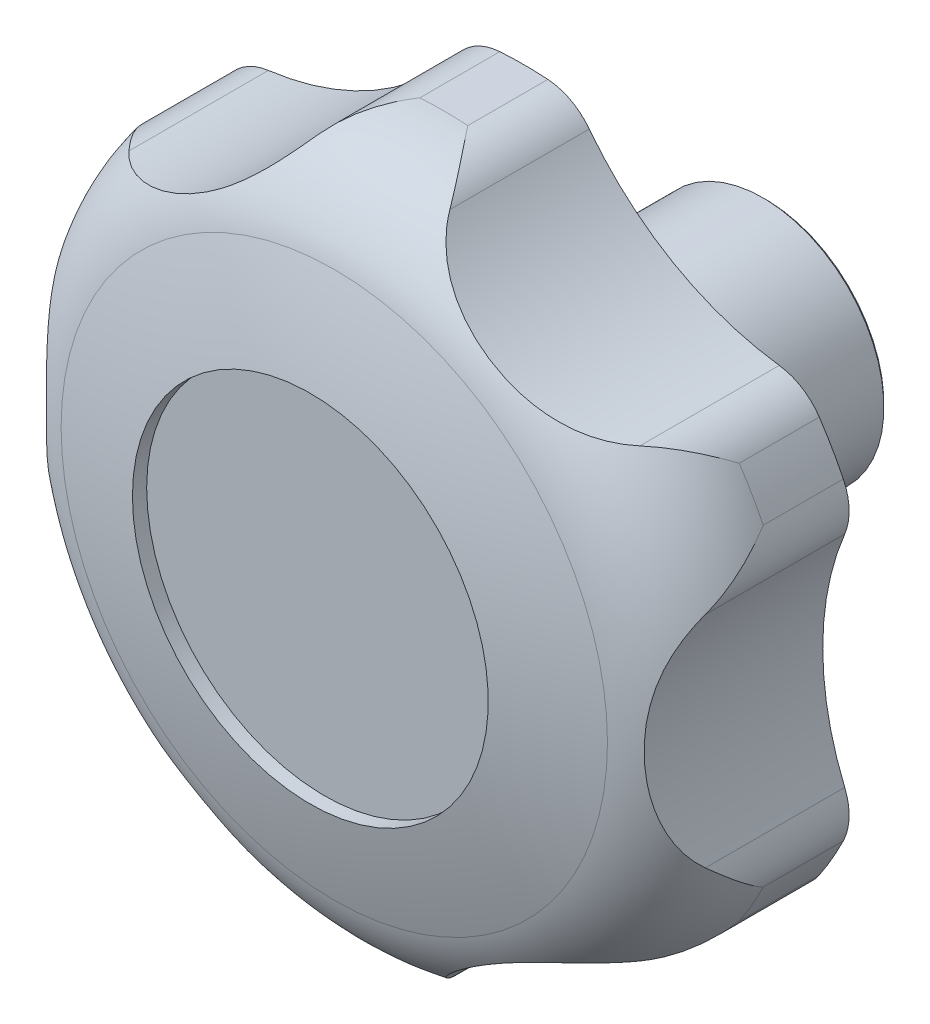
ISO-10303-21;
HEADER;
FILE_DESCRIPTION(('STEP AP214'),'2;1');
FILE_NAME('part.step','',(''),(''),'','','');
FILE_SCHEMA(('AUTOMOTIVE_DESIGN { 1 0 10303 214 1 1 1 1 }'));
ENDSEC;
DATA;
#1=APPLICATION_CONTEXT('core data for automotive mechanical design processes');
#2=APPLICATION_PROTOCOL_DEFINITION('international standard','automotive_design',2000,#1);
#3=PRODUCT_CONTEXT('',#1,'mechanical');
#4=PRODUCT('Part','Part','',(#3));
#5=PRODUCT_RELATED_PRODUCT_CATEGORY('part','',(#4));
#6=PRODUCT_DEFINITION_FORMATION('','',#4);
#7=PRODUCT_DEFINITION_CONTEXT('part definition',#1,'design');
#8=PRODUCT_DEFINITION('design','',#6,#7);
#9=PRODUCT_DEFINITION_SHAPE('','',#8);
#10=(LENGTH_UNIT() NAMED_UNIT(*) SI_UNIT(.MILLI.,.METRE.));
#11=(NAMED_UNIT(*) PLANE_ANGLE_UNIT() SI_UNIT($,.RADIAN.));
#12=(NAMED_UNIT(*) SI_UNIT($,.STERADIAN.) SOLID_ANGLE_UNIT());
#13=UNCERTAINTY_MEASURE_WITH_UNIT(LENGTH_MEASURE(1.E-05),#10,'distance_accuracy_value','');
#14=(GEOMETRIC_REPRESENTATION_CONTEXT(3) GLOBAL_UNCERTAINTY_ASSIGNED_CONTEXT((#13)) GLOBAL_UNIT_ASSIGNED_CONTEXT((#10,
#11,#12)) REPRESENTATION_CONTEXT('',''));
#15=CARTESIAN_POINT('',(0.,0.,0.));
#16=DIRECTION('',(0.,0.,1.));
#17=DIRECTION('',(1.,0.,0.));
#18=AXIS2_PLACEMENT_3D('',#15,#16,#17);
#19=CARTESIAN_POINT('',(0.,0.,39.106347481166));
#20=DIRECTION('',(0.,0.,1.));
#21=DIRECTION('',(-1.,0.,0.));
#22=AXIS2_PLACEMENT_3D('',#19,#20,#21);
#23=CYLINDRICAL_SURFACE('',#22,25.);
#24=CARTESIAN_POINT('',(0.,0.,17.));
#25=DIRECTION('',(0.,0.,1.));
#26=DIRECTION('',(-1.,0.,0.));
#27=AXIS2_PLACEMENT_3D('',#24,#25,#26);
#28=CIRCLE('',#27,25.);
#29=CARTESIAN_POINT('',(1.68710504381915,24.9430085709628,17.));
#30=VERTEX_POINT('',#29);
#31=CARTESIAN_POINT('',(-1.68710504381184,24.9430085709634,17.));
#32=VERTEX_POINT('',#31);
#33=EDGE_CURVE('E419',#30,#32,#28,.T.);
#34=ORIENTED_EDGE('',*,*,#33,.T.);
#35=DIRECTION('',(0.,0.,1.));
#36=VECTOR('',#35,1.);
#37=CARTESIAN_POINT('',(-1.68710504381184,24.9430085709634,0.));
#38=LINE('',#37,#36);
#39=CARTESIAN_POINT('',(-1.68710504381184,24.9430085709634,22.6238207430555));
#40=VERTEX_POINT('',#39);
#41=EDGE_CURVE('E214',#32,#40,#38,.T.);
#42=ORIENTED_EDGE('',*,*,#41,.T.);
#43=CARTESIAN_POINT('',(0.,0.,22.6238207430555));
#44=DIRECTION('',(0.,0.,1.));
#45=DIRECTION('',(-1.,0.,0.));
#46=AXIS2_PLACEMENT_3D('',#43,#44,#45);
#47=CIRCLE('',#46,25.);
#48=CARTESIAN_POINT('',(1.68710504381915,24.9430085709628,22.6238207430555));
#49=VERTEX_POINT('',#48);
#50=EDGE_CURVE('E434',#49,#40,#47,.T.);
#51=ORIENTED_EDGE('',*,*,#50,.F.);
#52=DIRECTION('',(0.,0.,1.));
#53=VECTOR('',#52,1.);
#54=CARTESIAN_POINT('',(1.68710504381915,24.9430085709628,0.));
#55=LINE('',#54,#53);
#56=EDGE_CURVE('E466',#30,#49,#55,.T.);
#57=ORIENTED_EDGE('',*,*,#56,.F.);
#58=EDGE_LOOP('',(#34,#42,#51,#57));
#59=FACE_BOUND('',#58,.T.);
#60=ADVANCED_FACE('F14',(#59),#23,.T.);
#61=CARTESIAN_POINT('',(22.444831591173,11.0104284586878,17.));
#62=VERTEX_POINT('',#61);
#63=CARTESIAN_POINT('',(20.7577265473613,13.9325801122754,17.));
#64=VERTEX_POINT('',#63);
#65=EDGE_CURVE('E423',#62,#64,#28,.T.);
#66=ORIENTED_EDGE('',*,*,#65,.T.);
#67=DIRECTION('',(0.,0.,1.));
#68=VECTOR('',#67,1.);
#69=CARTESIAN_POINT('',(20.7577265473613,13.9325801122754,0.));
#70=LINE('',#69,#68);
#71=CARTESIAN_POINT('',(20.7577265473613,13.9325801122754,22.6238207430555));
#72=VERTEX_POINT('',#71);
#73=EDGE_CURVE('E451',#64,#72,#70,.T.);
#74=ORIENTED_EDGE('',*,*,#73,.T.);
#75=CARTESIAN_POINT('',(22.444831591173,11.0104284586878,22.6238207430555));
#76=VERTEX_POINT('',#75);
#77=EDGE_CURVE('E481',#76,#72,#47,.T.);
#78=ORIENTED_EDGE('',*,*,#77,.F.);
#79=DIRECTION('',(0.,0.,1.));
#80=VECTOR('',#79,1.);
#81=CARTESIAN_POINT('',(22.444831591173,11.0104284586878,0.));
#82=LINE('',#81,#80);
#83=EDGE_CURVE('E453',#62,#76,#82,.T.);
#84=ORIENTED_EDGE('',*,*,#83,.F.);
#85=EDGE_LOOP('',(#66,#74,#78,#84));
#86=FACE_BOUND('',#85,.T.);
#87=ADVANCED_FACE('F394',(#86),#23,.T.);
#88=CARTESIAN_POINT('',(20.7577265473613,-13.9325801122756,17.));
#89=VERTEX_POINT('',#88);
#90=CARTESIAN_POINT('',(22.444831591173,-11.0104284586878,17.));
#91=VERTEX_POINT('',#90);
#92=EDGE_CURVE('E437',#89,#91,#28,.T.);
#93=ORIENTED_EDGE('',*,*,#92,.T.);
#94=DIRECTION('',(0.,0.,1.));
#95=VECTOR('',#94,1.);
#96=CARTESIAN_POINT('',(22.444831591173,-11.0104284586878,0.));
#97=LINE('',#96,#95);
#98=CARTESIAN_POINT('',(22.444831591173,-11.0104284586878,22.6238207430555));
#99=VERTEX_POINT('',#98);
#100=EDGE_CURVE('E540',#91,#99,#97,.T.);
#101=ORIENTED_EDGE('',*,*,#100,.T.);
#102=CARTESIAN_POINT('',(20.7577265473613,-13.9325801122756,22.6238207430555));
#103=VERTEX_POINT('',#102);
#104=EDGE_CURVE('E482',#103,#99,#47,.T.);
#105=ORIENTED_EDGE('',*,*,#104,.F.);
#106=DIRECTION('',(0.,0.,1.));
#107=VECTOR('',#106,1.);
#108=CARTESIAN_POINT('',(20.7577265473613,-13.9325801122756,0.));
#109=LINE('',#108,#107);
#110=EDGE_CURVE('E538',#89,#103,#109,.T.);
#111=ORIENTED_EDGE('',*,*,#110,.F.);
#112=EDGE_LOOP('',(#93,#101,#105,#111));
#113=FACE_BOUND('',#112,.T.);
#114=ADVANCED_FACE('F402',(#113),#23,.T.);
#115=CARTESIAN_POINT('',(-1.68710504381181,-24.9430085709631,17.));
#116=VERTEX_POINT('',#115);
#117=CARTESIAN_POINT('',(1.68710504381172,-24.9430085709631,17.));
#118=VERTEX_POINT('',#117);
#119=EDGE_CURVE('E430',#116,#118,#28,.T.);
#120=ORIENTED_EDGE('',*,*,#119,.T.);
#121=DIRECTION('',(0.,0.,1.));
#122=VECTOR('',#121,1.);
#123=CARTESIAN_POINT('',(1.68710504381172,-24.9430085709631,0.));
#124=LINE('',#123,#122);
#125=CARTESIAN_POINT('',(1.68710504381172,-24.9430085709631,22.6238207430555));
#126=VERTEX_POINT('',#125);
#127=EDGE_CURVE('E530',#118,#126,#124,.T.);
#128=ORIENTED_EDGE('',*,*,#127,.T.);
#129=CARTESIAN_POINT('',(-1.68710504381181,-24.9430085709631,22.6238207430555));
#130=VERTEX_POINT('',#129);
#131=EDGE_CURVE('E486',#130,#126,#47,.T.);
#132=ORIENTED_EDGE('',*,*,#131,.F.);
#133=DIRECTION('',(0.,0.,1.));
#134=VECTOR('',#133,1.);
#135=CARTESIAN_POINT('',(-1.68710504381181,-24.9430085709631,0.));
#136=LINE('',#135,#134);
#137=EDGE_CURVE('E528',#116,#130,#136,.T.);
#138=ORIENTED_EDGE('',*,*,#137,.F.);
#139=EDGE_LOOP('',(#120,#128,#132,#138));
#140=FACE_BOUND('',#139,.T.);
#141=ADVANCED_FACE('F414',(#140),#23,.T.);
#142=CARTESIAN_POINT('',(-22.4448315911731,-11.0104284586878,17.));
#143=VERTEX_POINT('',#142);
#144=CARTESIAN_POINT('',(-20.7577265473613,-13.9325801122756,17.));
#145=VERTEX_POINT('',#144);
#146=EDGE_CURVE('E422',#143,#145,#28,.T.);
#147=ORIENTED_EDGE('',*,*,#146,.T.);
#148=DIRECTION('',(0.,0.,1.));
#149=VECTOR('',#148,1.);
#150=CARTESIAN_POINT('',(-20.7577265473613,-13.9325801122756,0.));
#151=LINE('',#150,#149);
#152=CARTESIAN_POINT('',(-20.7577265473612,-13.9325801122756,22.6238207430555));
#153=VERTEX_POINT('',#152);
#154=EDGE_CURVE('E520',#145,#153,#151,.T.);
#155=ORIENTED_EDGE('',*,*,#154,.T.);
#156=CARTESIAN_POINT('',(-22.4448315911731,-11.0104284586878,22.6238207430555));
#157=VERTEX_POINT('',#156);
#158=EDGE_CURVE('E435',#157,#153,#47,.T.);
#159=ORIENTED_EDGE('',*,*,#158,.F.);
#160=DIRECTION('',(0.,0.,1.));
#161=VECTOR('',#160,1.);
#162=CARTESIAN_POINT('',(-22.4448315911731,-11.0104284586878,0.));
#163=LINE('',#162,#161);
#164=EDGE_CURVE('E518',#143,#157,#163,.T.);
#165=ORIENTED_EDGE('',*,*,#164,.F.);
#166=EDGE_LOOP('',(#147,#155,#159,#165));
#167=FACE_BOUND('',#166,.T.);
#168=ADVANCED_FACE('F406',(#167),#23,.T.);
#169=CARTESIAN_POINT('',(-20.7577265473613,13.9325801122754,17.));
#170=VERTEX_POINT('',#169);
#171=CARTESIAN_POINT('',(-22.4448315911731,11.0104284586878,17.));
#172=VERTEX_POINT('',#171);
#173=EDGE_CURVE('E210',#170,#172,#28,.T.);
#174=ORIENTED_EDGE('',*,*,#173,.T.);
#175=DIRECTION('',(0.,0.,1.));
#176=VECTOR('',#175,1.);
#177=CARTESIAN_POINT('',(-22.4448315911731,11.0104284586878,0.));
#178=LINE('',#177,#176);
#179=CARTESIAN_POINT('',(-22.4448315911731,11.0104284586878,22.6238207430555));
#180=VERTEX_POINT('',#179);
#181=EDGE_CURVE('E417',#172,#180,#178,.T.);
#182=ORIENTED_EDGE('',*,*,#181,.T.);
#183=CARTESIAN_POINT('',(-20.7577265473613,13.9325801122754,22.6238207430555));
#184=VERTEX_POINT('',#183);
#185=EDGE_CURVE('E429',#184,#180,#47,.T.);
#186=ORIENTED_EDGE('',*,*,#185,.F.);
#187=DIRECTION('',(0.,0.,1.));
#188=VECTOR('',#187,1.);
#189=CARTESIAN_POINT('',(-20.7577265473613,13.9325801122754,0.));
#190=LINE('',#189,#188);
#191=EDGE_CURVE('E203',#170,#184,#190,.T.);
#192=ORIENTED_EDGE('',*,*,#191,.F.);
#193=EDGE_LOOP('',(#174,#182,#186,#192));
#194=FACE_BOUND('',#193,.T.);
#195=ADVANCED_FACE('F396',(#194),#23,.T.);
#196=CARTESIAN_POINT('',(0.,11.,17.));
#197=DIRECTION('',(0.,0.,1.));
#198=DIRECTION('',(-1.,0.,0.));
#199=AXIS2_PLACEMENT_3D('',#196,#197,#198);
#200=PLANE('',#199);
#201=ORIENTED_EDGE('',*,*,#33,.F.);
#202=CARTESIAN_POINT('',(1.41716823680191,20.9521271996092,17.));
#203=DIRECTION('',(0.,0.,1.));
#204=DIRECTION('',(-1.,0.,0.));
#205=AXIS2_PLACEMENT_3D('',#202,#203,#204);
#206=CIRCLE('',#205,4.);
#207=CARTESIAN_POINT('',(4.59764019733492,23.377946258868,17.));
#208=VERTEX_POINT('',#207);
#209=EDGE_CURVE('E380',#30,#208,#206,.F.);
#210=ORIENTED_EDGE('',*,*,#209,.T.);
#211=CARTESIAN_POINT('',(20.5,35.507041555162,17.));
#212=DIRECTION('',(0.,0.,1.));
#213=DIRECTION('',(-1.,0.,0.));
#214=AXIS2_PLACEMENT_3D('',#211,#212,#213);
#215=CIRCLE('',#214,20.);
#216=CARTESIAN_POINT('',(17.9470752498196,15.6706463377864,17.));
#217=VERTEX_POINT('',#216);
#218=EDGE_CURVE('E458',#217,#208,#215,.F.);
#219=ORIENTED_EDGE('',*,*,#218,.F.);
#220=CARTESIAN_POINT('',(17.4364902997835,11.7033672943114,17.));
#221=DIRECTION('',(0.,0.,1.));
#222=DIRECTION('',(-1.,0.,0.));
#223=AXIS2_PLACEMENT_3D('',#220,#221,#222);
#224=CIRCLE('',#223,4.);
#225=EDGE_CURVE('E371',#217,#64,#224,.F.);
#226=ORIENTED_EDGE('',*,*,#225,.T.);
#227=ORIENTED_EDGE('',*,*,#65,.F.);
#228=CARTESIAN_POINT('',(18.8536585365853,9.24875990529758,17.));
#229=DIRECTION('',(0.,0.,1.));
#230=DIRECTION('',(-1.,0.,0.));
#231=AXIS2_PLACEMENT_3D('',#228,#229,#230);
#232=CIRCLE('',#231,4.);
#233=CARTESIAN_POINT('',(22.5447154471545,7.70729992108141,17.));
#234=VERTEX_POINT('',#233);
#235=EDGE_CURVE('E352',#62,#234,#232,.F.);
#236=ORIENTED_EDGE('',*,*,#235,.T.);
#237=CARTESIAN_POINT('',(41.,0.,17.));
#238=DIRECTION('',(0.,0.,1.));
#239=DIRECTION('',(-1.,0.,0.));
#240=AXIS2_PLACEMENT_3D('',#237,#238,#239);
#241=CIRCLE('',#240,20.);
#242=CARTESIAN_POINT('',(22.5447154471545,-7.70729992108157,17.));
#243=VERTEX_POINT('',#242);
#244=EDGE_CURVE('E570',#243,#234,#241,.F.);
#245=ORIENTED_EDGE('',*,*,#244,.F.);
#246=CARTESIAN_POINT('',(18.8536585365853,-9.2487599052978,17.));
#247=DIRECTION('',(0.,0.,1.));
#248=DIRECTION('',(-1.,0.,0.));
#249=AXIS2_PLACEMENT_3D('',#246,#247,#248);
#250=CIRCLE('',#249,4.);
#251=EDGE_CURVE('E343',#243,#91,#250,.F.);
#252=ORIENTED_EDGE('',*,*,#251,.T.);
#253=ORIENTED_EDGE('',*,*,#92,.F.);
#254=CARTESIAN_POINT('',(17.4364902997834,-11.7033672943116,17.));
#255=DIRECTION('',(0.,0.,1.));
#256=DIRECTION('',(-1.,0.,0.));
#257=AXIS2_PLACEMENT_3D('',#254,#255,#256);
#258=CIRCLE('',#257,4.);
#259=CARTESIAN_POINT('',(17.9470752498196,-15.6706463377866,17.));
#260=VERTEX_POINT('',#259);
#261=EDGE_CURVE('E320',#89,#260,#258,.F.);
#262=ORIENTED_EDGE('',*,*,#261,.T.);
#263=CARTESIAN_POINT('',(20.5,-35.5070415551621,17.));
#264=DIRECTION('',(0.,0.,1.));
#265=DIRECTION('',(-1.,0.,0.));
#266=AXIS2_PLACEMENT_3D('',#263,#264,#265);
#267=CIRCLE('',#266,20.);
#268=CARTESIAN_POINT('',(4.59764019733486,-23.3779462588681,17.));
#269=VERTEX_POINT('',#268);
#270=EDGE_CURVE('E569',#269,#260,#267,.F.);
#271=ORIENTED_EDGE('',*,*,#270,.F.);
#272=CARTESIAN_POINT('',(1.41716823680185,-20.9521271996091,17.));
#273=DIRECTION('',(0.,0.,1.));
#274=DIRECTION('',(-1.,0.,0.));
#275=AXIS2_PLACEMENT_3D('',#272,#273,#274);
#276=CIRCLE('',#275,4.);
#277=EDGE_CURVE('E310',#269,#118,#276,.F.);
#278=ORIENTED_EDGE('',*,*,#277,.T.);
#279=ORIENTED_EDGE('',*,*,#119,.F.);
#280=CARTESIAN_POINT('',(-1.41716823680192,-20.9521271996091,17.));
#281=DIRECTION('',(0.,0.,1.));
#282=DIRECTION('',(-1.,0.,0.));
#283=AXIS2_PLACEMENT_3D('',#280,#281,#282);
#284=CIRCLE('',#283,4.);
#285=CARTESIAN_POINT('',(-4.59764019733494,-23.3779462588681,17.));
#286=VERTEX_POINT('',#285);
#287=EDGE_CURVE('E299',#116,#286,#284,.F.);
#288=ORIENTED_EDGE('',*,*,#287,.T.);
#289=CARTESIAN_POINT('',(-20.5,-35.5070415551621,17.));
#290=DIRECTION('',(0.,0.,1.));
#291=DIRECTION('',(-1.,0.,0.));
#292=AXIS2_PLACEMENT_3D('',#289,#290,#291);
#293=CIRCLE('',#292,20.);
#294=CARTESIAN_POINT('',(-17.9470752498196,-15.6706463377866,17.));
#295=VERTEX_POINT('',#294);
#296=EDGE_CURVE('E571',#295,#286,#293,.F.);
#297=ORIENTED_EDGE('',*,*,#296,.F.);
#298=CARTESIAN_POINT('',(-17.4364902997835,-11.7033672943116,17.));
#299=DIRECTION('',(0.,0.,1.));
#300=DIRECTION('',(-1.,0.,0.));
#301=AXIS2_PLACEMENT_3D('',#298,#299,#300);
#302=CIRCLE('',#301,4.);
#303=EDGE_CURVE('E300',#295,#145,#302,.F.);
#304=ORIENTED_EDGE('',*,*,#303,.T.);
#305=ORIENTED_EDGE('',*,*,#146,.F.);
#306=CARTESIAN_POINT('',(-18.8536585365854,-9.2487599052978,17.));
#307=DIRECTION('',(0.,0.,1.));
#308=DIRECTION('',(-1.,0.,0.));
#309=AXIS2_PLACEMENT_3D('',#306,#307,#308);
#310=CIRCLE('',#309,4.);
#311=CARTESIAN_POINT('',(-22.5447154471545,-7.70729992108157,17.));
#312=VERTEX_POINT('',#311);
#313=EDGE_CURVE('E804',#143,#312,#310,.F.);
#314=ORIENTED_EDGE('',*,*,#313,.T.);
#315=CARTESIAN_POINT('',(-41.,0.,17.));
#316=DIRECTION('',(0.,0.,1.));
#317=DIRECTION('',(-1.,0.,0.));
#318=AXIS2_PLACEMENT_3D('',#315,#316,#317);
#319=CIRCLE('',#318,20.);
#320=CARTESIAN_POINT('',(-22.5447154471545,7.70729992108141,17.));
#321=VERTEX_POINT('',#320);
#322=EDGE_CURVE('E194',#321,#312,#319,.F.);
#323=ORIENTED_EDGE('',*,*,#322,.F.);
#324=CARTESIAN_POINT('',(-18.8536585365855,9.2487599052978,17.));
#325=DIRECTION('',(0.,0.,1.));
#326=DIRECTION('',(-1.,0.,0.));
#327=AXIS2_PLACEMENT_3D('',#324,#325,#326);
#328=CIRCLE('',#327,4.);
#329=EDGE_CURVE('E212',#321,#172,#328,.F.);
#330=ORIENTED_EDGE('',*,*,#329,.T.);
#331=ORIENTED_EDGE('',*,*,#173,.F.);
#332=CARTESIAN_POINT('',(-17.4364902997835,11.7033672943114,17.));
#333=DIRECTION('',(0.,0.,1.));
#334=DIRECTION('',(-1.,0.,0.));
#335=AXIS2_PLACEMENT_3D('',#332,#333,#334);
#336=CIRCLE('',#335,4.);
#337=CARTESIAN_POINT('',(-17.9470752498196,15.6706463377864,17.));
#338=VERTEX_POINT('',#337);
#339=EDGE_CURVE('E199',#170,#338,#336,.F.);
#340=ORIENTED_EDGE('',*,*,#339,.T.);
#341=CARTESIAN_POINT('',(-20.5,35.507041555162,17.));
#342=DIRECTION('',(0.,0.,1.));
#343=DIRECTION('',(-1.,0.,0.));
#344=AXIS2_PLACEMENT_3D('',#341,#342,#343);
#345=CIRCLE('',#344,20.);
#346=CARTESIAN_POINT('',(-4.59764019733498,23.377946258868,17.));
#347=VERTEX_POINT('',#346);
#348=EDGE_CURVE('E184',#347,#338,#345,.F.);
#349=ORIENTED_EDGE('',*,*,#348,.F.);
#350=CARTESIAN_POINT('',(-1.41716823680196,20.9521271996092,17.));
#351=DIRECTION('',(0.,0.,1.));
#352=DIRECTION('',(-1.,0.,0.));
#353=AXIS2_PLACEMENT_3D('',#350,#351,#352);
#354=CIRCLE('',#353,4.);
#355=EDGE_CURVE('E195',#347,#32,#354,.F.);
#356=ORIENTED_EDGE('',*,*,#355,.T.);
#357=EDGE_LOOP('',(#201,#210,#219,#226,#227,#236,#245,#252,#253,#262,#271,#278,#279,#288,#297,
#304,#305,#314,#323,#330,#331,#340,#349,#356));
#358=FACE_BOUND('',#357,.T.);
#359=CARTESIAN_POINT('',(0.,0.,17.));
#360=DIRECTION('',(0.,0.,1.));
#361=DIRECTION('',(-1.,0.,0.));
#362=AXIS2_PLACEMENT_3D('',#359,#360,#361);
#363=CIRCLE('',#362,11.);
#364=CARTESIAN_POINT('',(-11.,0.,17.));
#365=VERTEX_POINT('',#364);
#366=EDGE_CURVE('E500',#365,#365,#363,.T.);
#367=ORIENTED_EDGE('',*,*,#366,.T.);
#368=EDGE_LOOP('',(#367));
#369=FACE_BOUND('',#368,.T.);
#370=ADVANCED_FACE('F16',(#358,#369),#200,.F.);
#371=CARTESIAN_POINT('',(0.,0.,39.106347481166));
#372=DIRECTION('',(0.,0.,1.));
#373=DIRECTION('',(-1.,0.,0.));
#374=AXIS2_PLACEMENT_3D('',#371,#372,#373);
#375=CYLINDRICAL_SURFACE('',#374,11.);
#376=CARTESIAN_POINT('',(0.,0.,15.));
#377=DIRECTION('',(0.,0.,1.));
#378=DIRECTION('',(-1.,0.,0.));
#379=AXIS2_PLACEMENT_3D('',#376,#377,#378);
#380=CIRCLE('',#379,11.);
#381=CARTESIAN_POINT('',(-11.,0.,15.));
#382=VERTEX_POINT('',#381);
#383=EDGE_CURVE('E498',#382,#382,#380,.T.);
#384=ORIENTED_EDGE('',*,*,#383,.T.);
#385=EDGE_LOOP('',(#384));
#386=FACE_BOUND('',#385,.T.);
#387=ORIENTED_EDGE('',*,*,#366,.F.);
#388=EDGE_LOOP('',(#387));
#389=FACE_BOUND('',#388,.T.);
#390=ADVANCED_FACE('F413',(#386,#389),#375,.T.);
#391=CARTESIAN_POINT('',(0.,8.5,15.));
#392=DIRECTION('',(0.,0.,1.));
#393=DIRECTION('',(-1.,0.,0.));
#394=AXIS2_PLACEMENT_3D('',#391,#392,#393);
#395=PLANE('',#394);
#396=ORIENTED_EDGE('',*,*,#383,.F.);
#397=EDGE_LOOP('',(#396));
#398=FACE_BOUND('',#397,.T.);
#399=CARTESIAN_POINT('',(0.,0.,15.));
#400=DIRECTION('',(0.,0.,1.));
#401=DIRECTION('',(-1.,0.,0.));
#402=AXIS2_PLACEMENT_3D('',#399,#400,#401);
#403=CIRCLE('',#402,8.5);
#404=CARTESIAN_POINT('',(-8.5,0.,15.));
#405=VERTEX_POINT('',#404);
#406=EDGE_CURVE('E495',#405,#405,#403,.T.);
#407=ORIENTED_EDGE('',*,*,#406,.T.);
#408=EDGE_LOOP('',(#407));
#409=FACE_BOUND('',#408,.T.);
#410=ADVANCED_FACE('F601',(#398,#409),#395,.F.);
#411=CARTESIAN_POINT('',(0.,0.,39.106347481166));
#412=DIRECTION('',(0.,0.,1.));
#413=DIRECTION('',(-1.,0.,0.));
#414=AXIS2_PLACEMENT_3D('',#411,#412,#413);
#415=CYLINDRICAL_SURFACE('',#414,8.5);
#416=CARTESIAN_POINT('',(0.,0.,0.200000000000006));
#417=DIRECTION('',(0.,0.,1.));
#418=DIRECTION('',(-1.,0.,0.));
#419=AXIS2_PLACEMENT_3D('',#416,#417,#418);
#420=CIRCLE('',#419,8.5);
#421=CARTESIAN_POINT('',(-8.5,0.,0.200000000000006));
#422=VERTEX_POINT('',#421);
#423=EDGE_CURVE('E492',#422,#422,#420,.T.);
#424=ORIENTED_EDGE('',*,*,#423,.T.);
#425=EDGE_LOOP('',(#424));
#426=FACE_BOUND('',#425,.T.);
#427=ORIENTED_EDGE('',*,*,#406,.F.);
#428=EDGE_LOOP('',(#427));
#429=FACE_BOUND('',#428,.T.);
#430=ADVANCED_FACE('F597',(#426,#429),#415,.T.);
#431=CARTESIAN_POINT('',(0.,0.,0.));
#432=DIRECTION('',(0.,0.,1.));
#433=DIRECTION('',(-1.,0.,0.));
#434=AXIS2_PLACEMENT_3D('',#431,#432,#433);
#435=CONICAL_SURFACE('',#434,8.3,0.785398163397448);
#436=ORIENTED_EDGE('',*,*,#423,.F.);
#437=EDGE_LOOP('',(#436));
#438=FACE_BOUND('',#437,.T.);
#439=CARTESIAN_POINT('',(0.,0.,0.));
#440=DIRECTION('',(0.,0.,1.));
#441=DIRECTION('',(-1.,0.,0.));
#442=AXIS2_PLACEMENT_3D('',#439,#440,#441);
#443=CIRCLE('',#442,8.3);
#444=CARTESIAN_POINT('',(-8.3,0.,0.));
#445=VERTEX_POINT('',#444);
#446=EDGE_CURVE('E489',#445,#445,#443,.T.);
#447=ORIENTED_EDGE('',*,*,#446,.T.);
#448=EDGE_LOOP('',(#447));
#449=FACE_BOUND('',#448,.T.);
#450=ADVANCED_FACE('F591',(#438,#449),#435,.T.);
#451=CARTESIAN_POINT('',(0.,0.,0.));
#452=DIRECTION('',(0.,0.,1.));
#453=DIRECTION('',(-1.,0.,0.));
#454=AXIS2_PLACEMENT_3D('',#451,#452,#453);
#455=PLANE('',#454);
#456=CARTESIAN_POINT('',(0.,0.,0.));
#457=DIRECTION('',(0.,0.,-1.));
#458=DIRECTION('',(1.,0.,0.));
#459=AXIS2_PLACEMENT_3D('',#456,#457,#458);
#460=CIRCLE('',#459,5.);
#461=CARTESIAN_POINT('',(5.,0.,0.));
#462=VERTEX_POINT('',#461);
#463=EDGE_CURVE('E504',#462,#462,#460,.T.);
#464=ORIENTED_EDGE('',*,*,#463,.F.);
#465=EDGE_LOOP('',(#464));
#466=FACE_BOUND('',#465,.T.);
#467=ORIENTED_EDGE('',*,*,#446,.F.);
#468=EDGE_LOOP('',(#467));
#469=FACE_BOUND('',#468,.T.);
#470=ADVANCED_FACE('F584',(#466,#469),#455,.F.);
#471=CARTESIAN_POINT('',(0.,0.,-36.6463385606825));
#472=DIRECTION('',(0.,0.,1.));
#473=DIRECTION('',(-1.,0.,0.));
#474=AXIS2_PLACEMENT_3D('',#471,#472,#473);
#475=DEGENERATE_TOROIDAL_SURFACE('',#474,1.19964241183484,70.,.F.);
#476=CARTESIAN_POINT('',(0.,0.,30.317216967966));
#477=DIRECTION('',(0.,0.,1.));
#478=DIRECTION('',(-1.,0.,0.));
#479=AXIS2_PLACEMENT_3D('',#476,#477,#478);
#480=CIRCLE('',#479,19.1935483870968);
#481=CARTESIAN_POINT('',(-19.1935483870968,0.,30.317216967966));
#482=VERTEX_POINT('',#481);
#483=EDGE_CURVE('E485',#482,#482,#480,.T.);
#484=ORIENTED_EDGE('',*,*,#483,.T.);
#485=EDGE_LOOP('',(#484));
#486=FACE_BOUND('',#485,.T.);
#487=CARTESIAN_POINT('',(0.,0.,32.));
#488=DIRECTION('',(0.,0.,1.));
#489=DIRECTION('',(-1.,0.,0.));
#490=AXIS2_PLACEMENT_3D('',#487,#488,#489);
#491=CIRCLE('',#490,12.5);
#492=CARTESIAN_POINT('',(-12.5,0.,32.));
#493=VERTEX_POINT('',#492);
#494=EDGE_CURVE('E425',#493,#493,#491,.T.);
#495=ORIENTED_EDGE('',*,*,#494,.F.);
#496=EDGE_LOOP('',(#495));
#497=FACE_BOUND('',#496,.T.);
#498=ADVANCED_FACE('F582',(#486,#497),#475,.F.);
#499=CARTESIAN_POINT('',(0.,0.,22.6238207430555));
#500=DIRECTION('',(0.,0.,1.));
#501=DIRECTION('',(-1.,0.,0.));
#502=AXIS2_PLACEMENT_3D('',#499,#500,#501);
#503=TOROIDAL_SURFACE('',#502,17.,8.);
#504=CARTESIAN_POINT('',(1.6871050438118,24.9430085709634,22.6238207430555));
#505=CARTESIAN_POINT('',(1.69073909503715,24.942762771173,22.6285417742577));
#506=CARTESIAN_POINT('',(1.69437284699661,24.9425120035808,22.6332628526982));
#507=CARTESIAN_POINT('',(1.87946401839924,24.9294846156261,22.8737614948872));
#508=CARTESIAN_POINT('',(2.06014899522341,24.9043241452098,23.1096462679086));
#509=CARTESIAN_POINT('',(2.41740743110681,24.829350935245,23.5806622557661));
#510=CARTESIAN_POINT('',(2.59397934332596,24.7795290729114,23.8157931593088));
#511=CARTESIAN_POINT('',(2.94077285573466,24.6551804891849,24.2848490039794));
#512=CARTESIAN_POINT('',(3.11098412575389,24.5806153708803,24.5187714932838));
#513=CARTESIAN_POINT('',(3.44192774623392,24.4068725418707,24.9839347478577));
#514=CARTESIAN_POINT('',(3.60266612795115,24.3077107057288,25.2151771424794));
#515=CARTESIAN_POINT('',(3.91224597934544,24.0843947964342,25.6747372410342));
#516=CARTESIAN_POINT('',(4.0610536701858,23.9601730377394,25.9030452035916));
#517=CARTESIAN_POINT('',(4.27214053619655,23.7554678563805,26.2414437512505));
#518=CARTESIAN_POINT('',(4.34042478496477,23.6842446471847,26.3534648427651));
#519=CARTESIAN_POINT('',(4.47256192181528,23.5356227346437,26.5760997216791));
#520=CARTESIAN_POINT('',(4.53641283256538,23.4582213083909,26.6867128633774));
#521=CARTESIAN_POINT('',(4.59779273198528,23.377746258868,26.796508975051));
#522=B_SPLINE_CURVE_WITH_KNOTS('',3,(#504,#505,#506,#507,#508,#509,#510,#511,#512,#513,#514,
#515,#516,#517,#518,#519,#520,#521),.UNSPECIFIED.,.F.,.F.,(4,2,2,2,2,2,2,2,4),(0.,
0.0178885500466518,0.911260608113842,1.80496339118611,2.70005957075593,3.5945795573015,
4.49154874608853,4.93921044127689,5.38707053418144),.UNSPECIFIED.);
#523=CARTESIAN_POINT('',(4.59764019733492,23.377946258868,26.796236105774));
#524=VERTEX_POINT('',#523);
#525=EDGE_CURVE('E374',#49,#524,#522,.T.);
#526=ORIENTED_EDGE('',*,*,#525,.F.);
#527=ORIENTED_EDGE('',*,*,#50,.T.);
#528=CARTESIAN_POINT('',(-4.59779273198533,23.377746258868,26.796508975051));
#529=CARTESIAN_POINT('',(-4.49325605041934,23.5147571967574,26.6095689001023));
#530=CARTESIAN_POINT('',(-4.38160827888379,23.6428640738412,26.4202643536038));
#531=CARTESIAN_POINT('',(-4.14644934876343,23.8811358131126,26.0379860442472));
#532=CARTESIAN_POINT('',(-4.02294674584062,23.9913134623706,25.8450150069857));
#533=CARTESIAN_POINT('',(-3.76657567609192,24.1935565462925,25.4566398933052));
#534=CARTESIAN_POINT('',(-3.63372939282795,24.2856630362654,25.2612424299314));
#535=CARTESIAN_POINT('',(-3.36033897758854,24.4520846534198,24.8682984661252));
#536=CARTESIAN_POINT('',(-3.21979446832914,24.5263989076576,24.670751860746));
#537=CARTESIAN_POINT('',(-2.85660155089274,24.6919550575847,24.1688876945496));
#538=CARTESIAN_POINT('',(-2.62993299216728,24.7712789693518,23.8634968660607));
#539=CARTESIAN_POINT('',(-2.16859445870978,24.8880997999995,23.2513212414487));
#540=CARTESIAN_POINT('',(-1.93393522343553,24.9256507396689,22.9445387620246));
#541=CARTESIAN_POINT('',(-1.69437283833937,24.9425120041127,22.6332628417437));
#542=CARTESIAN_POINT('',(-1.6907390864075,24.9427627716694,22.6285417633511));
#543=CARTESIAN_POINT('',(-1.68710504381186,24.9430085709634,22.6238207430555));
#544=B_SPLINE_CURVE_WITH_KNOTS('',3,(#528,#529,#530,#531,#532,#533,#534,#535,#536,#537,#538,
#539,#540,#541,#542,#543),.UNSPECIFIED.,.F.,.F.,(4,2,2,2,2,2,2,4),(0.,0.762307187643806,
1.52406829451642,2.28407821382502,3.04412541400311,4.20717896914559,5.36872670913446,
5.38661525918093),.UNSPECIFIED.);
#545=CARTESIAN_POINT('',(-4.59764019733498,23.377946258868,26.7962361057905));
#546=VERTEX_POINT('',#545);
#547=EDGE_CURVE('E480',#546,#40,#544,.T.);
#548=ORIENTED_EDGE('',*,*,#547,.F.);
#549=CARTESIAN_POINT('',(-4.59748765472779,23.378146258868,26.79596321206));
#550=CARTESIAN_POINT('',(-4.68745740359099,23.260145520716,26.95706763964));
#551=CARTESIAN_POINT('',(-4.78366062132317,23.1367694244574,27.1105993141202));
#552=CARTESIAN_POINT('',(-4.98770324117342,22.8818683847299,27.4019414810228));
#553=CARTESIAN_POINT('',(-5.09552590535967,22.7503552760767,27.5397740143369));
#554=CARTESIAN_POINT('',(-5.32096382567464,22.4829423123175,27.7981438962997));
#555=CARTESIAN_POINT('',(-5.43845555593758,22.3471082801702,27.9188580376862));
#556=CARTESIAN_POINT('',(-5.68349322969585,22.0718238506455,28.1450671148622));
#557=CARTESIAN_POINT('',(-5.81104234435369,21.9323723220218,28.2505572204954));
#558=CARTESIAN_POINT('',(-6.07461744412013,21.6526168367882,28.4463134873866));
#559=CARTESIAN_POINT('',(-6.21059510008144,21.51232127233,28.5366571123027));
#560=CARTESIAN_POINT('',(-6.49077939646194,21.2318521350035,28.7036121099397));
#561=CARTESIAN_POINT('',(-6.6349853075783,21.0916785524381,28.7802246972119));
#562=CARTESIAN_POINT('',(-6.93128941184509,20.8124283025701,28.9209213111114));
#563=CARTESIAN_POINT('',(-7.08341006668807,20.6733562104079,28.9849669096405));
#564=CARTESIAN_POINT('',(-7.3944254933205,20.3978680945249,29.1012975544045));
#565=CARTESIAN_POINT('',(-7.5533218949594,20.2614527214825,29.1535797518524));
#566=CARTESIAN_POINT('',(-7.97410593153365,19.9116865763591,29.2754730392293));
#567=CARTESIAN_POINT('',(-8.24075460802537,19.7011167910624,29.3367475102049));
#568=CARTESIAN_POINT('',(-8.78734257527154,19.2919126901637,29.4355231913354));
#569=CARTESIAN_POINT('',(-9.06728849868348,19.0932844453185,29.4730124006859));
#570=CARTESIAN_POINT('',(-9.63920400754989,18.7093620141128,29.5268070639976));
#571=CARTESIAN_POINT('',(-9.93120356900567,18.5241046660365,29.5430559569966));
#572=CARTESIAN_POINT('',(-10.5246796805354,18.1688586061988,29.5553746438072));
#573=CARTESIAN_POINT('',(-10.8261546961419,17.9988674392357,29.551447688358));
#574=CARTESIAN_POINT('',(-11.4430750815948,17.6717820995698,29.522841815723));
#575=CARTESIAN_POINT('',(-11.7586802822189,17.5150254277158,29.497737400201));
#576=CARTESIAN_POINT('',(-12.3956325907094,17.2192723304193,29.4243261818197));
#577=CARTESIAN_POINT('',(-12.7169811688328,17.0802805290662,29.3760133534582));
#578=CARTESIAN_POINT('',(-13.3610540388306,16.8213387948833,29.2531219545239));
#579=CARTESIAN_POINT('',(-13.6837695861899,16.7013239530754,29.1786358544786));
#580=CARTESIAN_POINT('',(-14.3271826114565,16.4804364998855,28.9991434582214));
#581=CARTESIAN_POINT('',(-14.6478815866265,16.3795475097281,28.8941634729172));
#582=CARTESIAN_POINT('',(-15.1555460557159,16.2333162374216,28.697841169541));
#583=CARTESIAN_POINT('',(-15.3450819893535,16.1818181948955,28.6176170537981));
#584=CARTESIAN_POINT('',(-15.7195868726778,16.0857915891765,28.4435536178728));
#585=CARTESIAN_POINT('',(-15.9045573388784,16.0412606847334,28.3497188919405));
#586=CARTESIAN_POINT('',(-16.267646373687,15.9591067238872,28.1479603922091));
#587=CARTESIAN_POINT('',(-16.4457808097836,15.9214667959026,28.0400721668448));
#588=CARTESIAN_POINT('',(-16.7935555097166,15.8526864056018,27.8096475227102));
#589=CARTESIAN_POINT('',(-16.9631997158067,15.8215429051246,27.6871179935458));
#590=CARTESIAN_POINT('',(-17.2734523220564,15.768467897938,27.4418783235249));
#591=CARTESIAN_POINT('',(-17.4151836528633,15.7458950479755,27.3207286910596));
#592=CARTESIAN_POINT('',(-17.6889479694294,15.7050898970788,27.0669174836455));
#593=CARTESIAN_POINT('',(-17.820967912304,15.6868633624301,26.9342409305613));
#594=CARTESIAN_POINT('',(-17.9472752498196,15.6706205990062,26.796017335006));
#595=B_SPLINE_CURVE_WITH_KNOTS('',3,(#549,#550,#551,#552,#553,#554,#555,#556,#557,#558,#559,
#560,#561,#562,#563,#564,#565,#566,#567,#568,#569,#570,#571,#572,#573,#574,#575,#576,#577,#578,
#579,#580,#581,#582,#583,#584,#585,#586,#587,#588,#589,#590,#591,#592,#593,#594),.UNSPECIFIED.,
.F.,.F.,(4,2,2,2,2,2,2,2,2,2,2,2,2,2,2,2,2,2,2,2,2,2,4),(0.,0.656640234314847,1.31234690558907,
1.96069228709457,2.60924292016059,3.25436818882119,3.89943636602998,4.54644734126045,
5.19361483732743,6.22783106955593,7.26256869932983,8.3000561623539,9.33737647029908,
10.3960491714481,11.4549968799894,12.510240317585,13.5645759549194,14.2005435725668,
14.8362970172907,15.4704724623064,16.1043506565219,16.6671595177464,17.2307109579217),.UNSPECIFIED.);
#596=CARTESIAN_POINT('',(-17.9470752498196,15.6706463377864,26.796236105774));
#597=VERTEX_POINT('',#596);
#598=EDGE_CURVE('E258',#546,#597,#595,.T.);
#599=ORIENTED_EDGE('',*,*,#598,.T.);
#600=CARTESIAN_POINT('',(-20.7577265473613,13.9325801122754,22.6238207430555));
#601=CARTESIAN_POINT('',(-20.7556966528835,13.9356043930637,22.6285417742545));
#602=CARTESIAN_POINT('',(-20.7536626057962,13.938625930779,22.6332628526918));
#603=CARTESIAN_POINT('',(-20.6498349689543,14.0924058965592,22.8737614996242));
#604=CARTESIAN_POINT('',(-20.5377028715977,14.2363034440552,23.1096462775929));
#605=CARTESIAN_POINT('',(-20.2941449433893,14.5082117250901,23.5806622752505));
#606=CARTESIAN_POINT('',(-20.162711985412,14.636216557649,23.8157931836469));
#607=CARTESIAN_POINT('',(-19.8816261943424,14.8743742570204,24.2848490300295));
#608=CARTESIAN_POINT('',(-19.7319452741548,14.9844989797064,24.5187715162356));
#609=CARTESIAN_POINT('',(-19.4160077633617,15.1842331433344,24.9839347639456));
#610=CARTESIAN_POINT('',(-19.249761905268,15.2738557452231,25.2151771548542));
#611=CARTESIAN_POINT('',(-18.9015818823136,15.4302985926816,25.6747278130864));
#612=CARTESIAN_POINT('',(-18.7196066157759,15.4970566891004,25.9030264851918));
#613=CARTESIAN_POINT('',(-18.4367957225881,15.577508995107,26.2414114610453));
#614=CARTESIAN_POINT('',(-18.3409767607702,15.6010330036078,26.3534280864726));
#615=CARTESIAN_POINT('',(-18.1462066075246,15.6411562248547,26.576054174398));
#616=CARTESIAN_POINT('',(-18.0472540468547,15.657752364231,26.686662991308));
#617=CARTESIAN_POINT('',(-17.9468752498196,15.6706720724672,26.7964548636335));
#618=B_SPLINE_CURVE_WITH_KNOTS('',3,(#600,#601,#602,#603,#604,#605,#606,#607,#608,#609,#610,
#611,#612,#613,#614,#615,#616,#617),.UNSPECIFIED.,.F.,.F.,(4,2,2,2,2,2,2,2,4),(0.,
0.0178885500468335,0.911260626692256,1.80496342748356,2.70005959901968,3.59457955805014,
4.49151201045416,4.93915531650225,5.38699699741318),.UNSPECIFIED.);
#619=EDGE_CURVE('E202',#184,#597,#618,.T.);
#620=ORIENTED_EDGE('',*,*,#619,.F.);
#621=ORIENTED_EDGE('',*,*,#185,.T.);
#622=CARTESIAN_POINT('',(-22.5446319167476,7.7070999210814,26.7964712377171));
#623=CARTESIAN_POINT('',(-22.6110172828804,7.86613771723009,26.6095300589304));
#624=CARTESIAN_POINT('',(-22.6661359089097,8.0268818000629,26.4202244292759));
#625=CARTESIAN_POINT('',(-22.754903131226,8.34967281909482,26.037943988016));
#626=CARTESIAN_POINT('',(-22.7885670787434,8.5117187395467,25.8449719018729));
#627=CARTESIAN_POINT('',(-22.8355263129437,8.83486539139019,25.4565947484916));
#628=CARTESIAN_POINT('',(-22.8488682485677,8.99596743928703,25.2611962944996));
#629=CARTESIAN_POINT('',(-22.85629533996,9.31594223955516,24.8682503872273));
#630=CARTESIAN_POINT('',(-22.8503795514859,9.47481488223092,24.6707028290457));
#631=CARTESIAN_POINT('',(-22.812155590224,9.87212049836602,24.168845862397));
#632=CARTESIAN_POINT('',(-22.7675173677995,10.1080762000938,23.8634633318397));
#633=CARTESIAN_POINT('',(-22.6380192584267,10.5660041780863,23.2513044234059));
#634=CARTESIAN_POINT('',(-22.5532115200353,10.787994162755,22.9445303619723));
#635=CARTESIAN_POINT('',(-22.4480354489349,11.0038860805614,22.633262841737));
#636=CARTESIAN_POINT('',(-22.4464357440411,11.0071583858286,22.6285417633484));
#637=CARTESIAN_POINT('',(-22.4448315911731,11.0104284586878,22.6238207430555));
#638=B_SPLINE_CURVE_WITH_KNOTS('',3,(#622,#623,#624,#625,#626,#627,#628,#629,#630,#631,#632,
#633,#634,#635,#636,#637),.UNSPECIFIED.,.F.,.F.,(4,2,2,2,2,2,2,4),(0.,0.762310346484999,
1.52407463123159,2.28408764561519,3.04413792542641,4.20715956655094,5.36867547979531,
5.38656402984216),.UNSPECIFIED.);
#639=CARTESIAN_POINT('',(-22.5447154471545,7.70729992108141,26.796236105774));
#640=VERTEX_POINT('',#639);
#641=EDGE_CURVE('E35',#640,#180,#638,.T.);
#642=ORIENTED_EDGE('',*,*,#641,.F.);
#643=CARTESIAN_POINT('',(-22.5447989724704,7.70749992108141,26.796000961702));
#644=CARTESIAN_POINT('',(-22.4875916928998,7.57058155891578,26.9571049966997));
#645=CARTESIAN_POINT('',(-22.428846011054,7.42557716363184,27.1106361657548));
#646=CARTESIAN_POINT('',(-22.3101157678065,7.12141673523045,27.4019771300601));
#647=CARTESIAN_POINT('',(-22.2501330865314,6.9622811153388,27.5398089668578));
#648=CARTESIAN_POINT('',(-22.1312651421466,6.6333359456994,27.7981773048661));
#649=CARTESIAN_POINT('',(-22.0723751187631,6.46366628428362,27.9188906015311));
#650=CARTESIAN_POINT('',(-21.9564904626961,6.11381164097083,28.1450978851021));
#651=CARTESIAN_POINT('',(-21.899496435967,5.93362334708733,28.2505870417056));
#652=CARTESIAN_POINT('',(-21.7890087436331,5.56547946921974,28.4463413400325));
#653=CARTESIAN_POINT('',(-21.7354981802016,5.37756993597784,28.5366839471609));
#654=CARTESIAN_POINT('',(-21.6326973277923,4.99468544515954,28.7036368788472));
#655=CARTESIAN_POINT('',(-21.5834066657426,4.79971111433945,28.780248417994));
#656=CARTESIAN_POINT('',(-21.4897215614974,4.4034760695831,28.9209429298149));
#657=CARTESIAN_POINT('',(-21.4453423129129,4.20219819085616,28.9849874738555));
#658=CARTESIAN_POINT('',(-21.3622712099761,3.79510399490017,29.1013160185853));
#659=CARTESIAN_POINT('',(-21.3235807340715,3.58928659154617,29.1535971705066));
#660=CARTESIAN_POINT('',(-21.2310677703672,3.04999002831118,29.2754878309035));
#661=CARTESIAN_POINT('',(-21.1820343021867,2.71377823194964,29.3367607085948));
#662=CARTESIAN_POINT('',(-21.1009493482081,2.0358125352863,29.4355331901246));
#663=CARTESIAN_POINT('',(-21.0689064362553,1.69405592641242,29.4730207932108));
#664=CARTESIAN_POINT('',(-21.0223803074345,1.006797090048,29.5268121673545));
#665=CARTESIAN_POINT('',(-21.0079439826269,0.661287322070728,29.5430593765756));
#666=CARTESIAN_POINT('',(-20.9970330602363,-0.0303050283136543,29.5553745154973));
#667=CARTESIAN_POINT('',(-21.0005555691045,-0.376387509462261,29.5514456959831));
#668=CARTESIAN_POINT('',(-21.0257550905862,-1.07420211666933,29.5228357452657));
#669=CARTESIAN_POINT('',(-21.0478042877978,-1.42590390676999,29.4977291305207));
#670=CARTESIAN_POINT('',(-21.1101545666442,-2.1253997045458,29.4243130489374));
#671=CARTESIAN_POINT('',(-21.1504603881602,-2.47319267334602,29.3759975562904));
#672=CARTESIAN_POINT('',(-21.2482506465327,-3.16044858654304,29.2531002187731));
#673=CARTESIAN_POINT('',(-21.3056744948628,-3.4999364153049,29.1786108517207));
#674=CARTESIAN_POINT('',(-21.4360907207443,-4.16759265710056,28.9991111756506));
#675=CARTESIAN_POINT('',(-21.5090696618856,-4.49577055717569,28.8941271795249));
#676=CARTESIAN_POINT('',(-21.6362641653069,-5.00853364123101,28.6977986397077));
#677=CARTESIAN_POINT('',(-21.6864339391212,-5.19842309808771,28.6175726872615));
#678=CARTESIAN_POINT('',(-21.790525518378,-5.57076198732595,28.4435056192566));
#679=CARTESIAN_POINT('',(-21.8444460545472,-5.75321390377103,28.3496690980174));
#680=CARTESIAN_POINT('',(-21.9548433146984,-6.10872975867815,28.1479071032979));
#681=CARTESIAN_POINT('',(-22.0113133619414,-6.28181587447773,28.0400171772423));
#682=CARTESIAN_POINT('',(-22.1256348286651,-6.61738207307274,27.8095892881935));
#683=CARTESIAN_POINT('',(-22.1834855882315,-6.77986708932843,27.6870582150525));
#684=CARTESIAN_POINT('',(-22.2926436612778,-7.07507705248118,27.4418229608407));
#685=CARTESIAN_POINT('',(-22.343957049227,-7.20909576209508,27.3206799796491));
#686=CARTESIAN_POINT('',(-22.44549369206,-7.46656518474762,27.0668837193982));
#687=CARTESIAN_POINT('',(-22.4957154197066,-7.59000172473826,26.9342154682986));
#688=CARTESIAN_POINT('',(-22.5447989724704,-7.70749992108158,26.796000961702));
#689=B_SPLINE_CURVE_WITH_KNOTS('',3,(#643,#644,#645,#646,#647,#648,#649,#650,#651,#652,#653,
#654,#655,#656,#657,#658,#659,#660,#661,#662,#663,#664,#665,#666,#667,#668,#669,#670,#671,#672,
#673,#674,#675,#676,#677,#678,#679,#680,#681,#682,#683,#684,#685,#686,#687,#688),.UNSPECIFIED.,
.F.,.F.,(4,2,2,2,2,2,2,2,2,2,2,2,2,2,2,2,2,2,2,2,2,2,4),(0.,0.656643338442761,1.31235309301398,
1.96070148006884,2.60925512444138,3.25438332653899,3.89945443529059,4.54646837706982,
5.1936388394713,6.22786074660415,7.26260405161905,8.3000972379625,9.33742326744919,
10.3961007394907,11.4550532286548,12.5103012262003,13.56464137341,14.200604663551,
14.8363537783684,15.470524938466,16.1043988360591,16.6671691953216,17.2306818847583),.UNSPECIFIED.);
#690=CARTESIAN_POINT('',(-22.5447154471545,-7.70729992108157,26.796236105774));
#691=VERTEX_POINT('',#690);
#692=EDGE_CURVE('E249',#640,#691,#689,.T.);
#693=ORIENTED_EDGE('',*,*,#692,.T.);
#694=CARTESIAN_POINT('',(-22.444831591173,-11.0104284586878,22.6238207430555));
#695=CARTESIAN_POINT('',(-22.4464357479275,-11.0071583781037,22.62854177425));
#696=CARTESIAN_POINT('',(-22.4480354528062,-11.0038860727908,22.633262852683));
#697=CARTESIAN_POINT('',(-22.5292989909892,-10.8370787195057,22.8737614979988));
#698=CARTESIAN_POINT('',(-22.5978518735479,-10.6680207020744,23.1096462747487));
#699=CARTESIAN_POINT('',(-22.7115523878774,-10.3211392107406,23.5806622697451));
#700=CARTESIAN_POINT('',(-22.75669134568,-10.1433125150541,23.8157931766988));
#701=CARTESIAN_POINT('',(-22.8223990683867,-9.78080623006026,24.284849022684));
#702=CARTESIAN_POINT('',(-22.8429294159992,-9.59611638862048,24.5187715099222));
#703=CARTESIAN_POINT('',(-22.8579355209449,-9.22263939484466,24.9839347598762));
#704=CARTESIAN_POINT('',(-22.8524280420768,-9.03385495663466,25.2151771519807));
#705=CARTESIAN_POINT('',(-22.8138212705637,-8.65409842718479,25.6747306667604));
#706=CARTESIAN_POINT('',(-22.7806472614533,-8.46312179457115,25.9030321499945));
#707=CARTESIAN_POINT('',(-22.7089141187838,-8.17797071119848,26.2414212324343));
#708=CARTESIAN_POINT('',(-22.6813764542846,-8.08322589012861,26.3534392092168));
#709=CARTESIAN_POINT('',(-22.6187377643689,-7.89448609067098,26.5760679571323));
#710=CARTESIAN_POINT('',(-22.5836333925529,-7.80049146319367,26.686678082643));
#711=CARTESIAN_POINT('',(-22.5446319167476,-7.7070999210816,26.7964712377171));
#712=B_SPLINE_CURVE_WITH_KNOTS('',3,(#694,#695,#696,#697,#698,#699,#700,#701,#702,#703,#704,
#705,#706,#707,#708,#709,#710,#711),.UNSPECIFIED.,.F.,.F.,(4,2,2,2,2,2,2,2,4),(0.,
0.0178885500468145,0.911260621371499,1.80496341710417,2.70005959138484,3.59457955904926,
4.49152312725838,4.93917199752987,5.38701924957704),.UNSPECIFIED.);
#713=EDGE_CURVE('E806',#157,#691,#712,.T.);
#714=ORIENTED_EDGE('',*,*,#713,.F.);
#715=ORIENTED_EDGE('',*,*,#158,.T.);
#716=CARTESIAN_POINT('',(-17.9468752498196,-15.6706720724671,26.7964548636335));
#717=CARTESIAN_POINT('',(-18.1177987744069,-15.648643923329,26.6095132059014));
#718=CARTESIAN_POINT('',(-18.2845665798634,-15.6160053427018,26.420207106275));
#719=CARTESIAN_POINT('',(-18.6084954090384,-15.5314831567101,26.0379257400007));
#720=CARTESIAN_POINT('',(-18.7656632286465,-15.479613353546,25.844953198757));
#721=CARTESIAN_POINT('',(-19.0689959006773,-15.3587065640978,25.4565751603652));
#722=CARTESIAN_POINT('',(-19.2151852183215,-15.2897093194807,25.2611762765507));
#723=CARTESIAN_POINT('',(-19.4960047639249,-15.1361526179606,24.8682295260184));
#724=CARTESIAN_POINT('',(-19.6306344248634,-15.0515923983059,24.6706815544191));
#725=CARTESIAN_POINT('',(-19.9555959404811,-14.8198368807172,24.1688277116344));
#726=CARTESIAN_POINT('',(-20.1376177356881,-14.6632025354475,23.8634487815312));
#727=CARTESIAN_POINT('',(-20.4694412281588,-14.3220932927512,23.2512971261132));
#728=CARTESIAN_POINT('',(-20.6192843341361,-14.1376547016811,22.9445267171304));
#729=CARTESIAN_POINT('',(-20.7536626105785,-13.9386259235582,22.6332628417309));
#730=CARTESIAN_POINT('',(-20.7556966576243,-13.9356043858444,22.6285417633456));
#731=CARTESIAN_POINT('',(-20.7577265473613,-13.9325801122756,22.6238207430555));
#732=B_SPLINE_CURVE_WITH_KNOTS('',3,(#716,#717,#718,#719,#720,#721,#722,#723,#724,#725,#726,
#727,#728,#729,#730,#731),.UNSPECIFIED.,.F.,.F.,(4,2,2,2,2,2,2,4),(0.,0.762311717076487,
1.52407738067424,2.28409173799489,3.04414335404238,4.20715114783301,5.36865325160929,
5.38654180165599),.UNSPECIFIED.);
#733=CARTESIAN_POINT('',(-17.9470752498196,-15.6706463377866,26.796236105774));
#734=VERTEX_POINT('',#733);
#735=EDGE_CURVE('E808',#734,#153,#732,.T.);
#736=ORIENTED_EDGE('',*,*,#735,.F.);
#737=CARTESIAN_POINT('',(-17.9472752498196,-15.6706205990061,26.7960173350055));
#738=CARTESIAN_POINT('',(-17.8000960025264,-15.6895370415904,26.9571211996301));
#739=CARTESIAN_POINT('',(-17.6451448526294,-15.7111642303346,27.1106521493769));
#740=CARTESIAN_POINT('',(-17.3223674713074,-15.7604215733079,27.4019925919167));
#741=CARTESIAN_POINT('',(-17.1545598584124,-15.7880431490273,27.5398241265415));
#742=CARTESIAN_POINT('',(-16.8102495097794,-15.8495736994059,27.7981917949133));
#743=CARTESIAN_POINT('',(-16.633865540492,-15.8834086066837,27.9189047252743));
#744=CARTESIAN_POINT('',(-16.2729388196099,-15.9579775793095,28.1451112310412));
#745=CARTESIAN_POINT('',(-16.0883935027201,-15.9987138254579,28.2505999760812));
#746=CARTESIAN_POINT('',(-15.7143264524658,-16.0871013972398,28.446353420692));
#747=CARTESIAN_POINT('',(-15.5248361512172,-16.1347150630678,28.5366955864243));
#748=CARTESIAN_POINT('',(-15.1418469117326,-16.2371300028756,28.7036476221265));
#749=CARTESIAN_POINT('',(-14.9483483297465,-16.291930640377,28.7802587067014));
#750=CARTESIAN_POINT('',(-14.5583551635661,-16.4089153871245,28.9209523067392));
#751=CARTESIAN_POINT('',(-14.3618533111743,-16.4711212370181,28.9849963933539));
#752=CARTESIAN_POINT('',(-13.9677629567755,-16.6027276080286,29.1013240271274));
#753=CARTESIAN_POINT('',(-13.7701742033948,-16.67212986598,29.1536047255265));
#754=CARTESIAN_POINT('',(-13.2568720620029,-16.8616609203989,29.2754942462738));
#755=CARTESIAN_POINT('',(-12.9411866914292,-16.987303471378,29.3367664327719));
#756=CARTESIAN_POINT('',(-12.3135074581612,-17.2560665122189,29.4355375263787));
#757=CARTESIAN_POINT('',(-12.0015155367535,-17.3991957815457,29.4730244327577));
#758=CARTESIAN_POINT('',(-11.3830678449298,-17.7025343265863,29.5268143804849));
#759=CARTESIAN_POINT('',(-11.0766289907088,-17.8627879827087,29.5430608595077));
#760=CARTESIAN_POINT('',(-10.4722361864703,-18.1991370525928,29.5553744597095));
#761=CARTESIAN_POINT('',(-10.1742808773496,-18.3752299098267,29.5514448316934));
#762=CARTESIAN_POINT('',(-9.58255501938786,-18.7459626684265,29.5228331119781));
#763=CARTESIAN_POINT('',(-9.28899683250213,-18.9409097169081,29.4977255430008));
#764=CARTESIAN_POINT('',(-8.71439077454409,-19.3446564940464,29.4243073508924));
#765=CARTESIAN_POINT('',(-8.43334617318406,-19.5534598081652,29.3759907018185));
#766=CARTESIAN_POINT('',(-7.88706048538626,-19.9817784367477,29.2530907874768));
#767=CARTESIAN_POINT('',(-7.62176755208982,-20.2012537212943,29.1786000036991));
#768=CARTESIAN_POINT('',(-7.10876905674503,-20.6480271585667,28.9990971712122));
#769=CARTESIAN_POINT('',(-6.86104855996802,-20.8753184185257,28.8941114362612));
#770=CARTESIAN_POINT('',(-6.48058176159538,-21.2418536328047,28.6977803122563));
#771=CARTESIAN_POINT('',(-6.34121880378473,-21.3802460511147,28.6175537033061));
#772=CARTESIAN_POINT('',(-6.07081213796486,-21.6565601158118,28.4434853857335));
#773=CARTESIAN_POINT('',(-5.93976564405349,-21.7944819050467,28.3496482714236));
#774=CARTESIAN_POINT('',(-5.68708094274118,-22.0678451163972,28.1478851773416));
#775=CARTESIAN_POINT('',(-5.56542019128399,-22.2032918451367,28.0399947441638));
#776=CARTESIAN_POINT('',(-5.33197442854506,-22.470078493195,27.8095659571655));
#777=CARTESIAN_POINT('',(-5.2201848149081,-22.6014203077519,27.6870344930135));
#778=CARTESIAN_POINT('',(-5.0191052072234,-22.8435588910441,27.4417968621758));
#779=CARTESIAN_POINT('',(-4.92869795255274,-22.9550077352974,27.3206517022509));
#780=CARTESIAN_POINT('',(-4.75649074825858,-23.1716770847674,27.0668508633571));
#781=CARTESIAN_POINT('',(-4.67470230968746,-23.2768891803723,26.9341802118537));
#782=CARTESIAN_POINT('',(-4.59748765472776,-23.3781462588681,26.7959632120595));
#783=B_SPLINE_CURVE_WITH_KNOTS('',3,(#737,#738,#739,#740,#741,#742,#743,#744,#745,#746,#747,
#748,#749,#750,#751,#752,#753,#754,#755,#756,#757,#758,#759,#760,#761,#762,#763,#764,#765,#766,
#767,#768,#769,#770,#771,#772,#773,#774,#775,#776,#777,#778,#779,#780,#781,#782),.UNSPECIFIED.,
.F.,.F.,(4,2,2,2,2,2,2,2,2,2,2,2,2,2,2,2,2,2,2,2,2,2,4),(0.,0.656644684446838,1.31235577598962,
1.96070546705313,2.60926041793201,3.25438989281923,3.89946227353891,4.54647750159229,
5.19364925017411,6.22787361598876,7.26261937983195,8.30011505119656,9.33744356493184,
10.3961231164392,11.4550776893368,12.5103276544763,13.5646697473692,14.2006301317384,
14.8363763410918,15.4705446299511,16.1044156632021,16.6671921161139,17.2307109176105),.UNSPECIFIED.);
#784=CARTESIAN_POINT('',(-4.59764019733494,-23.3779462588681,26.796236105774));
#785=VERTEX_POINT('',#784);
#786=EDGE_CURVE('E257',#734,#785,#783,.T.);
#787=ORIENTED_EDGE('',*,*,#786,.T.);
#788=CARTESIAN_POINT('',(-1.68710504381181,-24.9430085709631,22.6238207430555));
#789=CARTESIAN_POINT('',(-1.69073909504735,-24.9427627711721,22.6285417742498));
#790=CARTESIAN_POINT('',(-1.69437284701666,-24.9425120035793,22.6332628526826));
#791=CARTESIAN_POINT('',(-1.87946401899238,-24.9294846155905,22.87376149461));
#792=CARTESIAN_POINT('',(-2.06014899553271,-24.9043241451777,23.1096462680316));
#793=CARTESIAN_POINT('',(-2.41740743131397,-24.8293509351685,23.5806622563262));
#794=CARTESIAN_POINT('',(-2.59397934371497,-24.779529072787,23.8157931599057));
#795=CARTESIAN_POINT('',(-2.9407728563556,-24.655180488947,24.2848490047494));
#796=CARTESIAN_POINT('',(-3.11098412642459,-24.5806153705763,24.5187714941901));
#797=CARTESIAN_POINT('',(-3.44192774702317,-24.4068725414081,24.983934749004));
#798=CARTESIAN_POINT('',(-3.60266612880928,-24.307710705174,25.2151771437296));
#799=CARTESIAN_POINT('',(-3.91224598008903,-24.084394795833,25.6747372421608));
#800=CARTESIAN_POINT('',(-4.0610536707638,-23.9601730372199,25.9030452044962));
#801=CARTESIAN_POINT('',(-4.27214053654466,-23.7554678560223,26.2414437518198));
#802=CARTESIAN_POINT('',(-4.34042478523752,-23.684244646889,26.3534648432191));
#803=CARTESIAN_POINT('',(-4.47256192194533,-23.5356227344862,26.5760997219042));
#804=CARTESIAN_POINT('',(-4.53641283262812,-23.458221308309,26.686712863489));
#805=CARTESIAN_POINT('',(-4.59779273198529,-23.3777462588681,26.796508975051));
#806=B_SPLINE_CURVE_WITH_KNOTS('',3,(#788,#789,#790,#791,#792,#793,#794,#795,#796,#797,#798,
#799,#800,#801,#802,#803,#804,#805),.UNSPECIFIED.,.F.,.F.,(4,2,2,2,2,2,2,2,4),(0.,
0.0178885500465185,0.911260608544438,1.80496339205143,2.70005957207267,3.59457955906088,
4.49154874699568,4.93921044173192,5.38707053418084),.UNSPECIFIED.);
#807=EDGE_CURVE('E292',#130,#785,#806,.T.);
#808=ORIENTED_EDGE('',*,*,#807,.F.);
#809=ORIENTED_EDGE('',*,*,#131,.T.);
#810=CARTESIAN_POINT('',(4.59779273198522,-23.3777462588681,26.796508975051));
#811=CARTESIAN_POINT('',(4.49325605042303,-23.51475719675,26.6095689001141));
#812=CARTESIAN_POINT('',(4.38160827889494,-23.6428640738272,26.4202643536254));
#813=CARTESIAN_POINT('',(4.1464493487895,-23.8811358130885,26.0379860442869));
#814=CARTESIAN_POINT('',(4.02294674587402,-23.9913134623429,25.8450150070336));
#815=CARTESIAN_POINT('',(3.76657567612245,-24.1935565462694,25.4566398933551));
#816=CARTESIAN_POINT('',(3.63372939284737,-24.2856630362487,25.2612424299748));
#817=CARTESIAN_POINT('',(3.36033897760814,-24.4520846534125,24.8682984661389));
#818=CARTESIAN_POINT('',(3.21979446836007,-24.5263989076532,24.6707518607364));
#819=CARTESIAN_POINT('',(2.85660155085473,-24.691955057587,24.1688876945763));
#820=CARTESIAN_POINT('',(2.62993299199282,-24.7712789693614,23.8634968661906));
#821=CARTESIAN_POINT('',(2.16859445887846,-24.8880997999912,23.2513212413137));
#822=CARTESIAN_POINT('',(1.9339352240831,-24.9256507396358,22.9445387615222));
#823=CARTESIAN_POINT('',(1.69437283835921,-24.9425120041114,22.6332628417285));
#824=CARTESIAN_POINT('',(1.69073908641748,-24.9427627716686,22.6285417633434));
#825=CARTESIAN_POINT('',(1.68710504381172,-24.9430085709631,22.6238207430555));
#826=B_SPLINE_CURVE_WITH_KNOTS('',3,(#810,#811,#812,#813,#814,#815,#816,#817,#818,#819,#820,
#821,#822,#823,#824,#825),.UNSPECIFIED.,.F.,.F.,(4,2,2,2,2,2,2,4),(0.,0.762307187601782,
1.52406829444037,2.2840782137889,3.04412541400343,4.20717896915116,5.3687267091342,
5.38661525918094),.UNSPECIFIED.);
#827=CARTESIAN_POINT('',(4.59764019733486,-23.3779462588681,26.796236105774));
#828=VERTEX_POINT('',#827);
#829=EDGE_CURVE('E304',#828,#126,#826,.T.);
#830=ORIENTED_EDGE('',*,*,#829,.F.);
#831=CARTESIAN_POINT('',(4.59748765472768,-23.3781462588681,26.7959632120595));
#832=CARTESIAN_POINT('',(4.68745740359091,-23.2601455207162,26.9570676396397));
#833=CARTESIAN_POINT('',(4.78366062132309,-23.1367694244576,27.1105993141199));
#834=CARTESIAN_POINT('',(4.98770324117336,-22.8818683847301,27.4019414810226));
#835=CARTESIAN_POINT('',(5.09552590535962,-22.7503552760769,27.5397740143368));
#836=CARTESIAN_POINT('',(5.32096382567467,-22.4829423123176,27.7981438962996));
#837=CARTESIAN_POINT('',(5.43845555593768,-22.3471082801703,27.9188580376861));
#838=CARTESIAN_POINT('',(5.68349322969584,-22.0718238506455,28.1450671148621));
#839=CARTESIAN_POINT('',(5.81104234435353,-21.9323723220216,28.2505572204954));
#840=CARTESIAN_POINT('',(6.07461744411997,-21.652616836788,28.4463134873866));
#841=CARTESIAN_POINT('',(6.21059510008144,-21.51232127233,28.5366571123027));
#842=CARTESIAN_POINT('',(6.49077939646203,-21.2318521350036,28.7036121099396));
#843=CARTESIAN_POINT('',(6.63498530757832,-21.0916785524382,28.7802246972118));
#844=CARTESIAN_POINT('',(6.93128941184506,-20.8124283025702,28.9209213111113));
#845=CARTESIAN_POINT('',(7.08341006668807,-20.6733562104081,28.9849669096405));
#846=CARTESIAN_POINT('',(7.39442549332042,-20.397868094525,29.1012975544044));
#847=CARTESIAN_POINT('',(7.55332189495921,-20.2614527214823,29.153579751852));
#848=CARTESIAN_POINT('',(7.97410593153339,-19.9116865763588,29.2754730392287));
#849=CARTESIAN_POINT('',(8.24075460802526,-19.7011167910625,29.3367475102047));
#850=CARTESIAN_POINT('',(8.78734257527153,-19.291912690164,29.4355231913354));
#851=CARTESIAN_POINT('',(9.06728849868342,-19.0932844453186,29.4730124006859));
#852=CARTESIAN_POINT('',(9.6392040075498,-18.7093620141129,29.5268070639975));
#853=CARTESIAN_POINT('',(9.93120356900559,-18.5241046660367,29.5430559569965));
#854=CARTESIAN_POINT('',(10.5246796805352,-18.168858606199,29.5553746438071));
#855=CARTESIAN_POINT('',(10.8261546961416,-17.9988674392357,29.551447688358));
#856=CARTESIAN_POINT('',(11.4430750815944,-17.6717820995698,29.522841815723));
#857=CARTESIAN_POINT('',(11.7586802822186,-17.515025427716,29.497737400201));
#858=CARTESIAN_POINT('',(12.3956325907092,-17.2192723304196,29.4243261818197));
#859=CARTESIAN_POINT('',(12.7169811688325,-17.0802805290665,29.3760133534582));
#860=CARTESIAN_POINT('',(13.3610540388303,-16.8213387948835,29.2531219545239));
#861=CARTESIAN_POINT('',(13.6837695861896,-16.7013239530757,29.1786358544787));
#862=CARTESIAN_POINT('',(14.3271826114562,-16.4804364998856,28.9991434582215));
#863=CARTESIAN_POINT('',(14.6478815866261,-16.3795475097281,28.8941634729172));
#864=CARTESIAN_POINT('',(15.1555460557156,-16.2333162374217,28.697841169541));
#865=CARTESIAN_POINT('',(15.3450819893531,-16.1818181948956,28.6176170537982));
#866=CARTESIAN_POINT('',(15.7195868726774,-16.0857915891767,28.4435536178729));
#867=CARTESIAN_POINT('',(15.9045573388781,-16.0412606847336,28.3497188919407));
#868=CARTESIAN_POINT('',(16.2676463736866,-15.9591067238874,28.1479603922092));
#869=CARTESIAN_POINT('',(16.4457808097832,-15.9214667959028,28.040072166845));
#870=CARTESIAN_POINT('',(16.7935555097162,-15.852686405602,27.8096475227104));
#871=CARTESIAN_POINT('',(16.9631997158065,-15.8215429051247,27.6871179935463));
#872=CARTESIAN_POINT('',(17.2734523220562,-15.7684678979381,27.4418783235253));
#873=CARTESIAN_POINT('',(17.4151836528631,-15.7458950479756,27.3207286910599));
#874=CARTESIAN_POINT('',(17.6889479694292,-15.7050898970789,27.0669174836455));
#875=CARTESIAN_POINT('',(17.8209679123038,-15.6868633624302,26.9342409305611));
#876=CARTESIAN_POINT('',(17.9472752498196,-15.6706205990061,26.796017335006));
#877=B_SPLINE_CURVE_WITH_KNOTS('',3,(#831,#832,#833,#834,#835,#836,#837,#838,#839,#840,#841,
#842,#843,#844,#845,#846,#847,#848,#849,#850,#851,#852,#853,#854,#855,#856,#857,#858,#859,#860,
#861,#862,#863,#864,#865,#866,#867,#868,#869,#870,#871,#872,#873,#874,#875,#876),.UNSPECIFIED.,
.F.,.F.,(4,2,2,2,2,2,2,2,2,2,2,2,2,2,2,2,2,2,2,2,2,2,4),(0.,0.656640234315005,1.31234690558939,
1.96069228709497,2.60924292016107,3.2543681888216,3.89943636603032,4.54644734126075,
5.1936148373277,6.2278310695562,7.26256869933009,8.30005616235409,9.3373764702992,
10.3960491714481,11.4549968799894,12.510240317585,13.5645759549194,14.2005435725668,
14.8362970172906,15.4704724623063,16.1043506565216,16.6671595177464,17.230710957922),.UNSPECIFIED.);
#878=CARTESIAN_POINT('',(17.9470752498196,-15.6706463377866,26.796236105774));
#879=VERTEX_POINT('',#878);
#880=EDGE_CURVE('E271',#828,#879,#877,.T.);
#881=ORIENTED_EDGE('',*,*,#880,.T.);
#882=CARTESIAN_POINT('',(20.7577265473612,-13.9325801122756,22.6238207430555));
#883=CARTESIAN_POINT('',(20.7556966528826,-13.935604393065,22.6285417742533));
#884=CARTESIAN_POINT('',(20.7536626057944,-13.9386259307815,22.6332628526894));
#885=CARTESIAN_POINT('',(20.6498349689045,-14.0924058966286,22.8737614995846));
#886=CARTESIAN_POINT('',(20.5377028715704,-14.2363034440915,23.1096462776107));
#887=CARTESIAN_POINT('',(20.2941449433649,-14.5082117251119,23.5806622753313));
#888=CARTESIAN_POINT('',(20.1627119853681,-14.6362165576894,23.8157931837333));
#889=CARTESIAN_POINT('',(19.8816261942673,-14.8743742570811,24.2848490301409));
#890=CARTESIAN_POINT('',(19.7319452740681,-14.9844989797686,24.5187715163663));
#891=CARTESIAN_POINT('',(19.416007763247,-15.1842331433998,24.9839347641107));
#892=CARTESIAN_POINT('',(19.2497619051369,-15.2738557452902,25.2151771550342));
#893=CARTESIAN_POINT('',(18.9015818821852,-15.4302985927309,25.6747278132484));
#894=CARTESIAN_POINT('',(18.7196066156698,-15.497056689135,25.9030264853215));
#895=CARTESIAN_POINT('',(18.4367957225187,-15.5775089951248,26.2414114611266));
#896=CARTESIAN_POINT('',(18.340976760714,-15.6010330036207,26.3534280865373));
#897=CARTESIAN_POINT('',(18.1462066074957,-15.6411562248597,26.57605417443));
#898=CARTESIAN_POINT('',(18.04725404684,-15.657752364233,26.6866629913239));
#899=CARTESIAN_POINT('',(17.9468752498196,-15.6706720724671,26.7964548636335));
#900=B_SPLINE_CURVE_WITH_KNOTS('',3,(#882,#883,#884,#885,#886,#887,#888,#889,#890,#891,#892,
#893,#894,#895,#896,#897,#898,#899),.UNSPECIFIED.,.F.,.F.,(4,2,2,2,2,2,2,2,4),(0.,
0.0178885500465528,0.911260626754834,1.80496342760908,2.70005959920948,3.59457955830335,
4.49151201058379,4.93915531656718,5.38699699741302),.UNSPECIFIED.);
#901=EDGE_CURVE('E313',#103,#879,#900,.T.);
#902=ORIENTED_EDGE('',*,*,#901,.F.);
#903=ORIENTED_EDGE('',*,*,#104,.T.);
#904=CARTESIAN_POINT('',(22.5446319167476,-7.7070999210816,26.7964712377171));
#905=CARTESIAN_POINT('',(22.6110172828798,-7.86613771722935,26.6095300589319));
#906=CARTESIAN_POINT('',(22.6661359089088,-8.02688180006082,26.4202244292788));
#907=CARTESIAN_POINT('',(22.7549031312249,-8.34967281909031,26.0379439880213));
#908=CARTESIAN_POINT('',(22.7885670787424,-8.51171873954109,25.8449719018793));
#909=CARTESIAN_POINT('',(22.835526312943,-8.83486539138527,25.4565947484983));
#910=CARTESIAN_POINT('',(22.848868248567,-8.99596743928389,25.2611962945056));
#911=CARTESIAN_POINT('',(22.8562953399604,-9.31594223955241,24.8682503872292));
#912=CARTESIAN_POINT('',(22.8503795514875,-9.4748148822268,24.6707028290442));
#913=CARTESIAN_POINT('',(22.8121555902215,-9.87212049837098,24.1688458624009));
#914=CARTESIAN_POINT('',(22.7675173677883,-10.1080762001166,23.8634633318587));
#915=CARTESIAN_POINT('',(22.6380192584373,-10.5660041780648,23.2513044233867));
#916=CARTESIAN_POINT('',(22.5532115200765,-10.7879941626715,22.9445303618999));
#917=CARTESIAN_POINT('',(22.448035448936,-11.0038860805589,22.6332628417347));
#918=CARTESIAN_POINT('',(22.4464357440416,-11.0071583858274,22.6285417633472));
#919=CARTESIAN_POINT('',(22.444831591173,-11.0104284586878,22.6238207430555));
#920=B_SPLINE_CURVE_WITH_KNOTS('',3,(#904,#905,#906,#907,#908,#909,#910,#911,#912,#913,#914,
#915,#916,#917,#918,#919),.UNSPECIFIED.,.F.,.F.,(4,2,2,2,2,2,2,4),(0.,0.762310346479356,
1.5240746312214,2.28408764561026,3.04413792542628,4.2071595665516,5.36867547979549,
5.38656402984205),.UNSPECIFIED.);
#921=CARTESIAN_POINT('',(22.5447154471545,-7.70729992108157,26.796236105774));
#922=VERTEX_POINT('',#921);
#923=EDGE_CURVE('E337',#922,#99,#920,.T.);
#924=ORIENTED_EDGE('',*,*,#923,.F.);
#925=CARTESIAN_POINT('',(22.5447989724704,-7.70749992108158,26.796000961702));
#926=CARTESIAN_POINT('',(22.4875916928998,-7.57058155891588,26.9571049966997));
#927=CARTESIAN_POINT('',(22.428846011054,-7.4255771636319,27.1106361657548));
#928=CARTESIAN_POINT('',(22.3101157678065,-7.12141673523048,27.4019771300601));
#929=CARTESIAN_POINT('',(22.2501330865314,-6.96228111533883,27.5398089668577));
#930=CARTESIAN_POINT('',(22.1312651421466,-6.63333594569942,27.7981773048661));
#931=CARTESIAN_POINT('',(22.0723751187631,-6.46366628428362,27.9188906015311));
#932=CARTESIAN_POINT('',(21.9564904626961,-6.11381164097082,28.1450978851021));
#933=CARTESIAN_POINT('',(21.899496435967,-5.93362334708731,28.2505870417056));
#934=CARTESIAN_POINT('',(21.789008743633,-5.56547946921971,28.4463413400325));
#935=CARTESIAN_POINT('',(21.7354981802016,-5.37756993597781,28.5366839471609));
#936=CARTESIAN_POINT('',(21.6326973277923,-4.99468544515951,28.7036368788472));
#937=CARTESIAN_POINT('',(21.5834066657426,-4.79971111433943,28.7802484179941));
#938=CARTESIAN_POINT('',(21.4897215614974,-4.40347606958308,28.9209429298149));
#939=CARTESIAN_POINT('',(21.4453423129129,-4.20219819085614,28.9849874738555));
#940=CARTESIAN_POINT('',(21.3622712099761,-3.79510399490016,29.1013160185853));
#941=CARTESIAN_POINT('',(21.3235807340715,-3.58928659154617,29.1535971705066));
#942=CARTESIAN_POINT('',(21.2310677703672,-3.0499900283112,29.2754878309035));
#943=CARTESIAN_POINT('',(21.1820343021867,-2.71377823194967,29.3367607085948));
#944=CARTESIAN_POINT('',(21.1009493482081,-2.03581253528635,29.4355331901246));
#945=CARTESIAN_POINT('',(21.0689064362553,-1.69405592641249,29.4730207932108));
#946=CARTESIAN_POINT('',(21.0223803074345,-1.00679709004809,29.5268121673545));
#947=CARTESIAN_POINT('',(21.007943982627,-0.661287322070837,29.5430593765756));
#948=CARTESIAN_POINT('',(20.9970330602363,0.0303050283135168,29.5553745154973));
#949=CARTESIAN_POINT('',(21.0005555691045,0.37638750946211,29.5514456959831));
#950=CARTESIAN_POINT('',(21.0257550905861,1.07420211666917,29.5228357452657));
#951=CARTESIAN_POINT('',(21.0478042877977,1.42590390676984,29.4977291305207));
#952=CARTESIAN_POINT('',(21.1101545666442,2.12539970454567,29.4243130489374));
#953=CARTESIAN_POINT('',(21.1504603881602,2.47319267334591,29.3759975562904));
#954=CARTESIAN_POINT('',(21.2482506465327,3.16044858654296,29.2531002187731));
#955=CARTESIAN_POINT('',(21.3056744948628,3.49993641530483,29.1786108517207));
#956=CARTESIAN_POINT('',(21.4360907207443,4.16759265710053,28.9991111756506));
#957=CARTESIAN_POINT('',(21.5090696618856,4.49577055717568,28.8941271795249));
#958=CARTESIAN_POINT('',(21.6362641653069,5.00853364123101,28.6977986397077));
#959=CARTESIAN_POINT('',(21.6864339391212,5.1984230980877,28.6175726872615));
#960=CARTESIAN_POINT('',(21.790525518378,5.57076198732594,28.4435056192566));
#961=CARTESIAN_POINT('',(21.8444460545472,5.75321390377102,28.3496690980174));
#962=CARTESIAN_POINT('',(21.9548433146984,6.10872975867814,28.1479071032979));
#963=CARTESIAN_POINT('',(22.0113133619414,6.28181587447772,28.0400171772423));
#964=CARTESIAN_POINT('',(22.1256348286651,6.61738207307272,27.8095892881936));
#965=CARTESIAN_POINT('',(22.1834855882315,6.77986708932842,27.6870582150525));
#966=CARTESIAN_POINT('',(22.2926436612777,7.07507705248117,27.4418229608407));
#967=CARTESIAN_POINT('',(22.343957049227,7.20909576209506,27.3206799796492));
#968=CARTESIAN_POINT('',(22.44549369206,7.46656518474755,27.0668837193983));
#969=CARTESIAN_POINT('',(22.4957154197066,7.59000172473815,26.9342154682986));
#970=CARTESIAN_POINT('',(22.5447989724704,7.70749992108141,26.796000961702));
#971=B_SPLINE_CURVE_WITH_KNOTS('',3,(#925,#926,#927,#928,#929,#930,#931,#932,#933,#934,#935,
#936,#937,#938,#939,#940,#941,#942,#943,#944,#945,#946,#947,#948,#949,#950,#951,#952,#953,#954,
#955,#956,#957,#958,#959,#960,#961,#962,#963,#964,#965,#966,#967,#968,#969,#970),.UNSPECIFIED.,
.F.,.F.,(4,2,2,2,2,2,2,2,2,2,2,2,2,2,2,2,2,2,2,2,2,2,4),(0.,0.656643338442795,1.31235309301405,
1.96070148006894,2.60925512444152,3.25438332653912,3.89945443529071,4.54646837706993,
5.19363883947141,6.22786074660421,7.26260405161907,8.30009723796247,9.33742326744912,
10.3961007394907,11.4550532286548,12.5103012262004,13.5646413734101,14.2006046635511,
14.8363537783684,15.4705249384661,16.1043988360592,16.6671691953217,17.2306818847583),.UNSPECIFIED.);
#972=CARTESIAN_POINT('',(22.5447154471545,7.70729992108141,26.796236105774));
#973=VERTEX_POINT('',#972);
#974=EDGE_CURVE('E28',#922,#973,#971,.T.);
#975=ORIENTED_EDGE('',*,*,#974,.T.);
#976=CARTESIAN_POINT('',(22.444831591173,11.0104284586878,22.6238207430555));
#977=CARTESIAN_POINT('',(22.446435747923,11.0071583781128,22.6285417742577));
#978=CARTESIAN_POINT('',(22.4480354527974,11.0038860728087,22.6332628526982));
#979=CARTESIAN_POINT('',(22.5292989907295,10.837078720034,22.8737614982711));
#980=CARTESIAN_POINT('',(22.5978518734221,10.6680207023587,23.1096462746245));
#981=CARTESIAN_POINT('',(22.7115523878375,10.3211392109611,23.5806622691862));
#982=CARTESIAN_POINT('',(22.7566913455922,10.1433125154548,23.8157931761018));
#983=CARTESIAN_POINT('',(22.8223990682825,9.78080623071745,24.2848490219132));
#984=CARTESIAN_POINT('',(22.8429294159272,9.59611638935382,24.5187715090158));
#985=CARTESIAN_POINT('',(22.8579355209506,9.22263939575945,24.9839347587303));
#986=CARTESIAN_POINT('',(22.8524280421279,9.03385495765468,25.2151771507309));
#987=CARTESIAN_POINT('',(22.8138212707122,8.65409842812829,25.6747306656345));
#988=CARTESIAN_POINT('',(22.7806472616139,8.46312179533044,25.903032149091));
#989=CARTESIAN_POINT('',(22.7089141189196,8.1779707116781,26.2414212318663));
#990=CARTESIAN_POINT('',(22.681376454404,8.08322589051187,26.353439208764));
#991=CARTESIAN_POINT('',(22.6187377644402,7.8944860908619,26.5760679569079));
#992=CARTESIAN_POINT('',(22.5836333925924,7.80049146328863,26.6866780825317));
#993=CARTESIAN_POINT('',(22.5446319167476,7.7070999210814,26.7964712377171));
#994=B_SPLINE_CURVE_WITH_KNOTS('',3,(#976,#977,#978,#979,#980,#981,#982,#983,#984,#985,#986,
#987,#988,#989,#990,#991,#992,#993),.UNSPECIFIED.,.F.,.F.,(4,2,2,2,2,2,2,2,4),(0.,
0.0178885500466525,0.911260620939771,1.80496341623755,2.70005959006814,3.59457955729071,
4.49152312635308,4.93917199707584,5.38701924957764),.UNSPECIFIED.);
#995=EDGE_CURVE('E346',#76,#973,#994,.T.);
#996=ORIENTED_EDGE('',*,*,#995,.F.);
#997=ORIENTED_EDGE('',*,*,#77,.T.);
#998=CARTESIAN_POINT('',(17.9468752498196,15.670672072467,26.7964548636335));
#999=CARTESIAN_POINT('',(18.1177987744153,15.6486439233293,26.6095132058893));
#1000=CARTESIAN_POINT('',(18.2845665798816,15.6160053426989,26.4202071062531));
#1001=CARTESIAN_POINT('',(18.6084954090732,15.5314831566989,26.0379257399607));
#1002=CARTESIAN_POINT('',(18.7656632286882,15.4796133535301,25.8449531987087));
#1003=CARTESIAN_POINT('',(19.0689959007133,15.3587065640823,25.4565751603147));
#1004=CARTESIAN_POINT('',(19.2151852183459,15.2897093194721,25.2611762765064));
#1005=CARTESIAN_POINT('',(19.4960047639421,15.1361526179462,24.8682295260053));
#1006=CARTESIAN_POINT('',(19.6306344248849,15.0515923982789,24.670681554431));
#1007=CARTESIAN_POINT('',(19.9555959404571,14.8198368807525,24.1688277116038));
#1008=CARTESIAN_POINT('',(20.1376177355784,14.6632025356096,23.8634487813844));
#1009=CARTESIAN_POINT('',(20.4694412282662,14.3220932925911,23.2512971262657));
#1010=CARTESIAN_POINT('',(20.6192843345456,14.1376547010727,22.9445267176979));
#1011=CARTESIAN_POINT('',(20.7536626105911,13.9386259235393,22.6332628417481));
#1012=CARTESIAN_POINT('',(20.7556966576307,13.9356043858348,22.6285417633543));
#1013=CARTESIAN_POINT('',(20.7577265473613,13.9325801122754,22.6238207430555));
#1014=B_SPLINE_CURVE_WITH_KNOTS('',3,(#998,#999,#1000,#1001,#1002,#1003,#1004,#1005,#1006,#1007,
#1008,#1009,#1010,#1011,#1012,#1013),.UNSPECIFIED.,.F.,.F.,(4,2,2,2,2,2,2,4),(0.,
0.762311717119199,1.52407738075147,2.28409173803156,3.04414335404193,4.20715114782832,
5.36865325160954,5.38654180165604),.UNSPECIFIED.);
#1015=CARTESIAN_POINT('',(17.9470752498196,15.6706463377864,26.796236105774));
#1016=VERTEX_POINT('',#1015);
#1017=EDGE_CURVE('E43',#1016,#72,#1014,.T.);
#1018=ORIENTED_EDGE('',*,*,#1017,.F.);
#1019=CARTESIAN_POINT('',(17.9472752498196,15.6706205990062,26.796017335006));
#1020=CARTESIAN_POINT('',(17.8000960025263,15.6895370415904,26.9571211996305));
#1021=CARTESIAN_POINT('',(17.6451448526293,15.7111642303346,27.1106521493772));
#1022=CARTESIAN_POINT('',(17.3223674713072,15.7604215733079,27.4019925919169));
#1023=CARTESIAN_POINT('',(17.1545598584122,15.7880431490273,27.5398241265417));
#1024=CARTESIAN_POINT('',(16.8102495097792,15.8495736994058,27.7981917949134));
#1025=CARTESIAN_POINT('',(16.6338655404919,15.8834086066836,27.9189047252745));
#1026=CARTESIAN_POINT('',(16.2729388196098,15.9579775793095,28.1451112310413));
#1027=CARTESIAN_POINT('',(16.0883935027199,15.9987138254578,28.2505999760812));
#1028=CARTESIAN_POINT('',(15.7143264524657,16.0871013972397,28.4463534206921));
#1029=CARTESIAN_POINT('',(15.5248361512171,16.1347150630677,28.5366955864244));
#1030=CARTESIAN_POINT('',(15.1418469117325,16.2371300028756,28.7036476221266));
#1031=CARTESIAN_POINT('',(14.9483483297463,16.2919306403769,28.7802587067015));
#1032=CARTESIAN_POINT('',(14.5583551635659,16.4089153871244,28.9209523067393));
#1033=CARTESIAN_POINT('',(14.3618533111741,16.4711212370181,28.984996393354));
#1034=CARTESIAN_POINT('',(13.9677629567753,16.6027276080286,29.1013240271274));
#1035=CARTESIAN_POINT('',(13.7701742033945,16.6721298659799,29.1536047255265));
#1036=CARTESIAN_POINT('',(13.2568720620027,16.8616609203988,29.2754942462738));
#1037=CARTESIAN_POINT('',(12.941186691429,16.987303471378,29.336766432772));
#1038=CARTESIAN_POINT('',(12.3135074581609,17.256066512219,29.4355375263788));
#1039=CARTESIAN_POINT('',(12.0015155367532,17.3991957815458,29.4730244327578));
#1040=CARTESIAN_POINT('',(11.3830678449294,17.7025343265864,29.526814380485));
#1041=CARTESIAN_POINT('',(11.0766289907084,17.8627879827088,29.5430608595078));
#1042=CARTESIAN_POINT('',(10.4722361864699,18.199137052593,29.5553744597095));
#1043=CARTESIAN_POINT('',(10.1742808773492,18.375229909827,29.5514448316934));
#1044=CARTESIAN_POINT('',(9.58255501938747,18.7459626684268,29.5228331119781));
#1045=CARTESIAN_POINT('',(9.28899683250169,18.9409097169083,29.4977255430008));
#1046=CARTESIAN_POINT('',(8.71439077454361,19.3446564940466,29.4243073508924));
#1047=CARTESIAN_POINT('',(8.4333461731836,19.5534598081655,29.3759907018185));
#1048=CARTESIAN_POINT('',(7.88706048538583,19.981778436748,29.2530907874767));
#1049=CARTESIAN_POINT('',(7.6217675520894,20.2012537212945,29.178600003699));
#1050=CARTESIAN_POINT('',(7.10876905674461,20.648027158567,28.9990971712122));
#1051=CARTESIAN_POINT('',(6.86104855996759,20.875318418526,28.8941114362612));
#1052=CARTESIAN_POINT('',(6.480581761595,21.241853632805,28.6977803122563));
#1053=CARTESIAN_POINT('',(6.34121880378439,21.380246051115,28.617553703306));
#1054=CARTESIAN_POINT('',(6.07081213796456,21.656560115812,28.4434853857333));
#1055=CARTESIAN_POINT('',(5.93976564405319,21.7944819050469,28.3496482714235));
#1056=CARTESIAN_POINT('',(5.68708094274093,22.0678451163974,28.1478851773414));
#1057=CARTESIAN_POINT('',(5.56542019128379,22.2032918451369,28.0399947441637));
#1058=CARTESIAN_POINT('',(5.33197442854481,22.4700784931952,27.8095659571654));
#1059=CARTESIAN_POINT('',(5.22018481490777,22.601420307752,27.6870344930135));
#1060=CARTESIAN_POINT('',(5.01910520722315,22.8435588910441,27.4417968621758));
#1061=CARTESIAN_POINT('',(4.92869795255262,22.9550077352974,27.320651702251));
#1062=CARTESIAN_POINT('',(4.75649074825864,23.1716770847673,27.0668508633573));
#1063=CARTESIAN_POINT('',(4.67470230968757,23.2768891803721,26.9341802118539));
#1064=CARTESIAN_POINT('',(4.59748765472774,23.378146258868,26.79596321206));
#1065=B_SPLINE_CURVE_WITH_KNOTS('',3,(#1019,#1020,#1021,#1022,#1023,#1024,#1025,#1026,#1027,
#1028,#1029,#1030,#1031,#1032,#1033,#1034,#1035,#1036,#1037,#1038,#1039,#1040,#1041,#1042,#1043,
#1044,#1045,#1046,#1047,#1048,#1049,#1050,#1051,#1052,#1053,#1054,#1055,#1056,#1057,#1058,#1059,
#1060,#1061,#1062,#1063,#1064),.UNSPECIFIED.,.F.,.F.,(4,2,2,2,2,2,2,2,2,2,2,2,2,2,2,2,2,2,2,2,2,
2,4),(0.,0.656644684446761,1.31235577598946,1.96070546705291,2.60926041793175,3.254389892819,
3.89946227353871,4.54647750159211,5.19364925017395,6.22787361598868,7.26261937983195,
8.30011505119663,9.33744356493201,10.3961231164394,11.455077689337,12.5103276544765,
13.5646697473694,14.2006301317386,14.8363763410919,15.4705446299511,16.1044156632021,
16.6671921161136,17.2307109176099),.UNSPECIFIED.);
#1066=EDGE_CURVE('E9',#1016,#524,#1065,.T.);
#1067=ORIENTED_EDGE('',*,*,#1066,.T.);
#1068=EDGE_LOOP('',(#526,#527,#548,#599,#620,#621,#642,#693,#714,#715,#736,#787,#808,#809,#830,
#881,#902,#903,#924,#975,#996,#997,#1018,#1067));
#1069=FACE_BOUND('',#1068,.T.);
#1070=ORIENTED_EDGE('',*,*,#483,.F.);
#1071=EDGE_LOOP('',(#1070));
#1072=FACE_BOUND('',#1071,.T.);
#1073=ADVANCED_FACE('F229',(#1069,#1072),#503,.T.);
#1074=CARTESIAN_POINT('',(0.,0.,31.));
#1075=DIRECTION('',(0.,0.,1.));
#1076=DIRECTION('',(-1.,0.,0.));
#1077=AXIS2_PLACEMENT_3D('',#1074,#1075,#1076);
#1078=CYLINDRICAL_SURFACE('',#1077,12.5);
#1079=CARTESIAN_POINT('',(0.,0.,31.));
#1080=DIRECTION('',(0.,0.,1.));
#1081=DIRECTION('',(-1.,0.,0.));
#1082=AXIS2_PLACEMENT_3D('',#1079,#1080,#1081);
#1083=CIRCLE('',#1082,12.5);
#1084=CARTESIAN_POINT('',(-12.5,0.,31.));
#1085=VERTEX_POINT('',#1084);
#1086=EDGE_CURVE('E420',#1085,#1085,#1083,.T.);
#1087=ORIENTED_EDGE('',*,*,#1086,.F.);
#1088=EDGE_LOOP('',(#1087));
#1089=FACE_BOUND('',#1088,.T.);
#1090=ORIENTED_EDGE('',*,*,#494,.T.);
#1091=EDGE_LOOP('',(#1090));
#1092=FACE_BOUND('',#1091,.T.);
#1093=ADVANCED_FACE('F389',(#1089,#1092),#1078,.F.);
#1094=CARTESIAN_POINT('',(0.,0.,31.));
#1095=DIRECTION('',(0.,0.,1.));
#1096=DIRECTION('',(-1.,0.,0.));
#1097=AXIS2_PLACEMENT_3D('',#1094,#1095,#1096);
#1098=PLANE('',#1097);
#1099=ORIENTED_EDGE('',*,*,#1086,.T.);
#1100=EDGE_LOOP('',(#1099));
#1101=FACE_BOUND('',#1100,.T.);
#1102=ADVANCED_FACE('F386',(#1101),#1098,.T.);
#1103=CARTESIAN_POINT('',(-17.4364902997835,11.7033672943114,0.));
#1104=DIRECTION('',(0.,0.,1.));
#1105=DIRECTION('',(-1.,0.,0.));
#1106=AXIS2_PLACEMENT_3D('',#1103,#1104,#1105);
#1107=CYLINDRICAL_SURFACE('',#1106,4.);
#1108=ORIENTED_EDGE('',*,*,#191,.T.);
#1109=ORIENTED_EDGE('',*,*,#619,.T.);
#1110=DIRECTION('',(0.,0.,1.));
#1111=VECTOR('',#1110,1.);
#1112=CARTESIAN_POINT('',(-17.9470752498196,15.6706463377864,0.));
#1113=LINE('',#1112,#1111);
#1114=EDGE_CURVE('E187',#338,#597,#1113,.T.);
#1115=ORIENTED_EDGE('',*,*,#1114,.F.);
#1116=ORIENTED_EDGE('',*,*,#339,.F.);
#1117=EDGE_LOOP('',(#1108,#1109,#1115,#1116));
#1118=FACE_BOUND('',#1117,.T.);
#1119=ADVANCED_FACE('F198',(#1118),#1107,.T.);
#1120=CARTESIAN_POINT('',(-1.41716823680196,20.9521271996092,0.));
#1121=DIRECTION('',(0.,0.,1.));
#1122=DIRECTION('',(-1.,0.,0.));
#1123=AXIS2_PLACEMENT_3D('',#1120,#1121,#1122);
#1124=CYLINDRICAL_SURFACE('',#1123,4.);
#1125=DIRECTION('',(0.,0.,1.));
#1126=VECTOR('',#1125,1.);
#1127=CARTESIAN_POINT('',(-4.59764019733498,23.377946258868,0.));
#1128=LINE('',#1127,#1126);
#1129=EDGE_CURVE('E190',#347,#546,#1128,.T.);
#1130=ORIENTED_EDGE('',*,*,#1129,.T.);
#1131=ORIENTED_EDGE('',*,*,#547,.T.);
#1132=ORIENTED_EDGE('',*,*,#41,.F.);
#1133=ORIENTED_EDGE('',*,*,#355,.F.);
#1134=EDGE_LOOP('',(#1130,#1131,#1132,#1133));
#1135=FACE_BOUND('',#1134,.T.);
#1136=ADVANCED_FACE('F503',(#1135),#1124,.T.);
#1137=CARTESIAN_POINT('',(-20.5,35.507041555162,0.));
#1138=DIRECTION('',(0.,0.,1.));
#1139=DIRECTION('',(-1.,0.,0.));
#1140=AXIS2_PLACEMENT_3D('',#1137,#1138,#1139);
#1141=CYLINDRICAL_SURFACE('',#1140,20.);
#1142=ORIENTED_EDGE('',*,*,#348,.T.);
#1143=ORIENTED_EDGE('',*,*,#1114,.T.);
#1144=ORIENTED_EDGE('',*,*,#598,.F.);
#1145=ORIENTED_EDGE('',*,*,#1129,.F.);
#1146=EDGE_LOOP('',(#1142,#1143,#1144,#1145));
#1147=FACE_BOUND('',#1146,.T.);
#1148=ADVANCED_FACE('F186',(#1147),#1141,.F.);
#1149=CARTESIAN_POINT('',(-18.8536585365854,-9.2487599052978,0.));
#1150=DIRECTION('',(0.,0.,1.));
#1151=DIRECTION('',(-1.,0.,0.));
#1152=AXIS2_PLACEMENT_3D('',#1149,#1150,#1151);
#1153=CYLINDRICAL_SURFACE('',#1152,4.);
#1154=ORIENTED_EDGE('',*,*,#164,.T.);
#1155=ORIENTED_EDGE('',*,*,#713,.T.);
#1156=DIRECTION('',(0.,0.,1.));
#1157=VECTOR('',#1156,1.);
#1158=CARTESIAN_POINT('',(-22.5447154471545,-7.70729992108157,0.));
#1159=LINE('',#1158,#1157);
#1160=EDGE_CURVE('E515',#312,#691,#1159,.T.);
#1161=ORIENTED_EDGE('',*,*,#1160,.F.);
#1162=ORIENTED_EDGE('',*,*,#313,.F.);
#1163=EDGE_LOOP('',(#1154,#1155,#1161,#1162));
#1164=FACE_BOUND('',#1163,.T.);
#1165=ADVANCED_FACE('F238',(#1164),#1153,.T.);
#1166=CARTESIAN_POINT('',(-18.8536585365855,9.2487599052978,0.));
#1167=DIRECTION('',(0.,0.,1.));
#1168=DIRECTION('',(-1.,0.,0.));
#1169=AXIS2_PLACEMENT_3D('',#1166,#1167,#1168);
#1170=CYLINDRICAL_SURFACE('',#1169,4.);
#1171=DIRECTION('',(0.,0.,1.));
#1172=VECTOR('',#1171,1.);
#1173=CARTESIAN_POINT('',(-22.5447154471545,7.70729992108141,0.));
#1174=LINE('',#1173,#1172);
#1175=EDGE_CURVE('E513',#321,#640,#1174,.T.);
#1176=ORIENTED_EDGE('',*,*,#1175,.T.);
#1177=ORIENTED_EDGE('',*,*,#641,.T.);
#1178=ORIENTED_EDGE('',*,*,#181,.F.);
#1179=ORIENTED_EDGE('',*,*,#329,.F.);
#1180=EDGE_LOOP('',(#1176,#1177,#1178,#1179));
#1181=FACE_BOUND('',#1180,.T.);
#1182=ADVANCED_FACE('F233',(#1181),#1170,.T.);
#1183=CARTESIAN_POINT('',(-41.,0.,0.));
#1184=DIRECTION('',(0.,0.,1.));
#1185=DIRECTION('',(-1.,0.,0.));
#1186=AXIS2_PLACEMENT_3D('',#1183,#1184,#1185);
#1187=CYLINDRICAL_SURFACE('',#1186,20.);
#1188=ORIENTED_EDGE('',*,*,#322,.T.);
#1189=ORIENTED_EDGE('',*,*,#1160,.T.);
#1190=ORIENTED_EDGE('',*,*,#692,.F.);
#1191=ORIENTED_EDGE('',*,*,#1175,.F.);
#1192=EDGE_LOOP('',(#1188,#1189,#1190,#1191));
#1193=FACE_BOUND('',#1192,.T.);
#1194=ADVANCED_FACE('F237',(#1193),#1187,.F.);
#1195=CARTESIAN_POINT('',(-1.41716823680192,-20.9521271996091,0.));
#1196=DIRECTION('',(0.,0.,1.));
#1197=DIRECTION('',(-1.,0.,0.));
#1198=AXIS2_PLACEMENT_3D('',#1195,#1196,#1197);
#1199=CYLINDRICAL_SURFACE('',#1198,4.);
#1200=ORIENTED_EDGE('',*,*,#137,.T.);
#1201=ORIENTED_EDGE('',*,*,#807,.T.);
#1202=DIRECTION('',(0.,0.,1.));
#1203=VECTOR('',#1202,1.);
#1204=CARTESIAN_POINT('',(-4.59764019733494,-23.3779462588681,0.));
#1205=LINE('',#1204,#1203);
#1206=EDGE_CURVE('E525',#286,#785,#1205,.T.);
#1207=ORIENTED_EDGE('',*,*,#1206,.F.);
#1208=ORIENTED_EDGE('',*,*,#287,.F.);
#1209=EDGE_LOOP('',(#1200,#1201,#1207,#1208));
#1210=FACE_BOUND('',#1209,.T.);
#1211=ADVANCED_FACE('F244',(#1210),#1199,.T.);
#1212=CARTESIAN_POINT('',(-17.4364902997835,-11.7033672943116,0.));
#1213=DIRECTION('',(0.,0.,1.));
#1214=DIRECTION('',(-1.,0.,0.));
#1215=AXIS2_PLACEMENT_3D('',#1212,#1213,#1214);
#1216=CYLINDRICAL_SURFACE('',#1215,4.);
#1217=DIRECTION('',(0.,0.,1.));
#1218=VECTOR('',#1217,1.);
#1219=CARTESIAN_POINT('',(-17.9470752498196,-15.6706463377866,0.));
#1220=LINE('',#1219,#1218);
#1221=EDGE_CURVE('E522',#295,#734,#1220,.T.);
#1222=ORIENTED_EDGE('',*,*,#1221,.T.);
#1223=ORIENTED_EDGE('',*,*,#735,.T.);
#1224=ORIENTED_EDGE('',*,*,#154,.F.);
#1225=ORIENTED_EDGE('',*,*,#303,.F.);
#1226=EDGE_LOOP('',(#1222,#1223,#1224,#1225));
#1227=FACE_BOUND('',#1226,.T.);
#1228=ADVANCED_FACE('F282',(#1227),#1216,.T.);
#1229=CARTESIAN_POINT('',(-20.5,-35.5070415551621,0.));
#1230=DIRECTION('',(0.,0.,1.));
#1231=DIRECTION('',(-1.,0.,0.));
#1232=AXIS2_PLACEMENT_3D('',#1229,#1230,#1231);
#1233=CYLINDRICAL_SURFACE('',#1232,20.);
#1234=ORIENTED_EDGE('',*,*,#296,.T.);
#1235=ORIENTED_EDGE('',*,*,#1206,.T.);
#1236=ORIENTED_EDGE('',*,*,#786,.F.);
#1237=ORIENTED_EDGE('',*,*,#1221,.F.);
#1238=EDGE_LOOP('',(#1234,#1235,#1236,#1237));
#1239=FACE_BOUND('',#1238,.T.);
#1240=ADVANCED_FACE('F277',(#1239),#1233,.F.);
#1241=CARTESIAN_POINT('',(17.4364902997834,-11.7033672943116,0.));
#1242=DIRECTION('',(0.,0.,1.));
#1243=DIRECTION('',(-1.,0.,0.));
#1244=AXIS2_PLACEMENT_3D('',#1241,#1242,#1243);
#1245=CYLINDRICAL_SURFACE('',#1244,4.);
#1246=ORIENTED_EDGE('',*,*,#110,.T.);
#1247=ORIENTED_EDGE('',*,*,#901,.T.);
#1248=DIRECTION('',(0.,0.,1.));
#1249=VECTOR('',#1248,1.);
#1250=CARTESIAN_POINT('',(17.9470752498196,-15.6706463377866,0.));
#1251=LINE('',#1250,#1249);
#1252=EDGE_CURVE('E535',#260,#879,#1251,.T.);
#1253=ORIENTED_EDGE('',*,*,#1252,.F.);
#1254=ORIENTED_EDGE('',*,*,#261,.F.);
#1255=EDGE_LOOP('',(#1246,#1247,#1253,#1254));
#1256=FACE_BOUND('',#1255,.T.);
#1257=ADVANCED_FACE('F281',(#1256),#1245,.T.);
#1258=CARTESIAN_POINT('',(1.41716823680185,-20.9521271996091,0.));
#1259=DIRECTION('',(0.,0.,1.));
#1260=DIRECTION('',(-1.,0.,0.));
#1261=AXIS2_PLACEMENT_3D('',#1258,#1259,#1260);
#1262=CYLINDRICAL_SURFACE('',#1261,4.);
#1263=DIRECTION('',(0.,0.,1.));
#1264=VECTOR('',#1263,1.);
#1265=CARTESIAN_POINT('',(4.59764019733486,-23.3779462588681,0.));
#1266=LINE('',#1265,#1264);
#1267=EDGE_CURVE('E532',#269,#828,#1266,.T.);
#1268=ORIENTED_EDGE('',*,*,#1267,.T.);
#1269=ORIENTED_EDGE('',*,*,#829,.T.);
#1270=ORIENTED_EDGE('',*,*,#127,.F.);
#1271=ORIENTED_EDGE('',*,*,#277,.F.);
#1272=EDGE_LOOP('',(#1268,#1269,#1270,#1271));
#1273=FACE_BOUND('',#1272,.T.);
#1274=ADVANCED_FACE('F289',(#1273),#1262,.T.);
#1275=CARTESIAN_POINT('',(20.5,-35.5070415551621,0.));
#1276=DIRECTION('',(0.,0.,1.));
#1277=DIRECTION('',(-1.,0.,0.));
#1278=AXIS2_PLACEMENT_3D('',#1275,#1276,#1277);
#1279=CYLINDRICAL_SURFACE('',#1278,20.);
#1280=ORIENTED_EDGE('',*,*,#270,.T.);
#1281=ORIENTED_EDGE('',*,*,#1252,.T.);
#1282=ORIENTED_EDGE('',*,*,#880,.F.);
#1283=ORIENTED_EDGE('',*,*,#1267,.F.);
#1284=EDGE_LOOP('',(#1280,#1281,#1282,#1283));
#1285=FACE_BOUND('',#1284,.T.);
#1286=ADVANCED_FACE('F326',(#1285),#1279,.F.);
#1287=CARTESIAN_POINT('',(18.8536585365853,9.24875990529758,0.));
#1288=DIRECTION('',(0.,0.,1.));
#1289=DIRECTION('',(-1.,0.,0.));
#1290=AXIS2_PLACEMENT_3D('',#1287,#1288,#1289);
#1291=CYLINDRICAL_SURFACE('',#1290,4.);
#1292=ORIENTED_EDGE('',*,*,#83,.T.);
#1293=ORIENTED_EDGE('',*,*,#995,.T.);
#1294=DIRECTION('',(0.,0.,1.));
#1295=VECTOR('',#1294,1.);
#1296=CARTESIAN_POINT('',(22.5447154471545,7.70729992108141,0.));
#1297=LINE('',#1296,#1295);
#1298=EDGE_CURVE('E545',#234,#973,#1297,.T.);
#1299=ORIENTED_EDGE('',*,*,#1298,.F.);
#1300=ORIENTED_EDGE('',*,*,#235,.F.);
#1301=EDGE_LOOP('',(#1292,#1293,#1299,#1300));
#1302=FACE_BOUND('',#1301,.T.);
#1303=ADVANCED_FACE('F333',(#1302),#1291,.T.);
#1304=CARTESIAN_POINT('',(18.8536585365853,-9.2487599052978,0.));
#1305=DIRECTION('',(0.,0.,1.));
#1306=DIRECTION('',(-1.,0.,0.));
#1307=AXIS2_PLACEMENT_3D('',#1304,#1305,#1306);
#1308=CYLINDRICAL_SURFACE('',#1307,4.);
#1309=DIRECTION('',(0.,0.,1.));
#1310=VECTOR('',#1309,1.);
#1311=CARTESIAN_POINT('',(22.5447154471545,-7.70729992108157,0.));
#1312=LINE('',#1311,#1310);
#1313=EDGE_CURVE('E542',#243,#922,#1312,.T.);
#1314=ORIENTED_EDGE('',*,*,#1313,.T.);
#1315=ORIENTED_EDGE('',*,*,#923,.T.);
#1316=ORIENTED_EDGE('',*,*,#100,.F.);
#1317=ORIENTED_EDGE('',*,*,#251,.F.);
#1318=EDGE_LOOP('',(#1314,#1315,#1316,#1317));
#1319=FACE_BOUND('',#1318,.T.);
#1320=ADVANCED_FACE('F328',(#1319),#1308,.T.);
#1321=CARTESIAN_POINT('',(41.,0.,0.));
#1322=DIRECTION('',(0.,0.,1.));
#1323=DIRECTION('',(-1.,0.,0.));
#1324=AXIS2_PLACEMENT_3D('',#1321,#1322,#1323);
#1325=CYLINDRICAL_SURFACE('',#1324,20.);
#1326=ORIENTED_EDGE('',*,*,#244,.T.);
#1327=ORIENTED_EDGE('',*,*,#1298,.T.);
#1328=ORIENTED_EDGE('',*,*,#974,.F.);
#1329=ORIENTED_EDGE('',*,*,#1313,.F.);
#1330=EDGE_LOOP('',(#1326,#1327,#1328,#1329));
#1331=FACE_BOUND('',#1330,.T.);
#1332=ADVANCED_FACE('F332',(#1331),#1325,.F.);
#1333=CARTESIAN_POINT('',(20.5,35.507041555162,0.));
#1334=DIRECTION('',(0.,0.,1.));
#1335=DIRECTION('',(-1.,0.,0.));
#1336=AXIS2_PLACEMENT_3D('',#1333,#1334,#1335);
#1337=CYLINDRICAL_SURFACE('',#1336,20.);
#1338=ORIENTED_EDGE('',*,*,#218,.T.);
#1339=DIRECTION('',(0.,0.,1.));
#1340=VECTOR('',#1339,1.);
#1341=CARTESIAN_POINT('',(4.59764019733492,23.377946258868,0.));
#1342=LINE('',#1341,#1340);
#1343=EDGE_CURVE('E464',#208,#524,#1342,.T.);
#1344=ORIENTED_EDGE('',*,*,#1343,.T.);
#1345=ORIENTED_EDGE('',*,*,#1066,.F.);
#1346=DIRECTION('',(0.,0.,1.));
#1347=VECTOR('',#1346,1.);
#1348=CARTESIAN_POINT('',(17.9470752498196,15.6706463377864,0.));
#1349=LINE('',#1348,#1347);
#1350=EDGE_CURVE('E460',#217,#1016,#1349,.T.);
#1351=ORIENTED_EDGE('',*,*,#1350,.F.);
#1352=EDGE_LOOP('',(#1338,#1344,#1345,#1351));
#1353=FACE_BOUND('',#1352,.T.);
#1354=ADVANCED_FACE('F363',(#1353),#1337,.F.);
#1355=CARTESIAN_POINT('',(1.41716823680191,20.9521271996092,0.));
#1356=DIRECTION('',(0.,0.,1.));
#1357=DIRECTION('',(-1.,0.,0.));
#1358=AXIS2_PLACEMENT_3D('',#1355,#1356,#1357);
#1359=CYLINDRICAL_SURFACE('',#1358,4.);
#1360=ORIENTED_EDGE('',*,*,#56,.T.);
#1361=ORIENTED_EDGE('',*,*,#525,.T.);
#1362=ORIENTED_EDGE('',*,*,#1343,.F.);
#1363=ORIENTED_EDGE('',*,*,#209,.F.);
#1364=EDGE_LOOP('',(#1360,#1361,#1362,#1363));
#1365=FACE_BOUND('',#1364,.T.);
#1366=ADVANCED_FACE('F362',(#1365),#1359,.T.);
#1367=CARTESIAN_POINT('',(17.4364902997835,11.7033672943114,0.));
#1368=DIRECTION('',(0.,0.,1.));
#1369=DIRECTION('',(-1.,0.,0.));
#1370=AXIS2_PLACEMENT_3D('',#1367,#1368,#1369);
#1371=CYLINDRICAL_SURFACE('',#1370,4.);
#1372=ORIENTED_EDGE('',*,*,#1350,.T.);
#1373=ORIENTED_EDGE('',*,*,#1017,.T.);
#1374=ORIENTED_EDGE('',*,*,#73,.F.);
#1375=ORIENTED_EDGE('',*,*,#225,.F.);
#1376=EDGE_LOOP('',(#1372,#1373,#1374,#1375));
#1377=FACE_BOUND('',#1376,.T.);
#1378=ADVANCED_FACE('F358',(#1377),#1371,.T.);
#1379=CARTESIAN_POINT('',(0.,0.,19.));
#1380=DIRECTION('',(0.,0.,-1.));
#1381=DIRECTION('',(1.,0.,0.));
#1382=AXIS2_PLACEMENT_3D('',#1379,#1380,#1381);
#1383=CYLINDRICAL_SURFACE('',#1382,5.);
#1384=CARTESIAN_POINT('',(0.,0.,16.));
#1385=DIRECTION('',(0.,0.,-1.));
#1386=DIRECTION('',(-1.,0.,0.));
#1387=AXIS2_PLACEMENT_3D('',#1384,#1385,#1386);
#1388=CIRCLE('',#1387,5.);
#1389=CARTESIAN_POINT('',(-5.,0.,16.));
#1390=VERTEX_POINT('',#1389);
#1391=EDGE_CURVE('E507',#1390,#1390,#1388,.T.);
#1392=ORIENTED_EDGE('',*,*,#1391,.F.);
#1393=EDGE_LOOP('',(#1392));
#1394=FACE_BOUND('',#1393,.T.);
#1395=ORIENTED_EDGE('',*,*,#463,.T.);
#1396=EDGE_LOOP('',(#1395));
#1397=FACE_BOUND('',#1396,.T.);
#1398=ADVANCED_FACE('F361',(#1394,#1397),#1383,.F.);
#1399=CARTESIAN_POINT('',(0.,0.,16.));
#1400=DIRECTION('',(0.,0.,-1.));
#1401=DIRECTION('',(-1.,0.,0.));
#1402=AXIS2_PLACEMENT_3D('',#1399,#1400,#1401);
#1403=PLANE('',#1402);
#1404=ORIENTED_EDGE('',*,*,#1391,.T.);
#1405=EDGE_LOOP('',(#1404));
#1406=FACE_BOUND('',#1405,.T.);
#1407=ADVANCED_FACE('F839',(#1406),#1403,.T.);
#1408=CLOSED_SHELL('',(#60,#87,#114,#141,#168,#195,#370,#390,#410,#430,#450,#470,#498,#1073,
#1093,#1102,#1119,#1136,#1148,#1165,#1182,#1194,#1211,#1228,#1240,#1257,#1274,#1286,#1303,#1320,
#1332,#1354,#1366,#1378,#1398,#1407));
#1409=MANIFOLD_SOLID_BREP('B1',#1408);
#1410=ADVANCED_BREP_SHAPE_REPRESENTATION('',(#18,#1409),#14);
#1411=SHAPE_DEFINITION_REPRESENTATION(#9,#1410);
ENDSEC;
END-ISO-10303-21;
